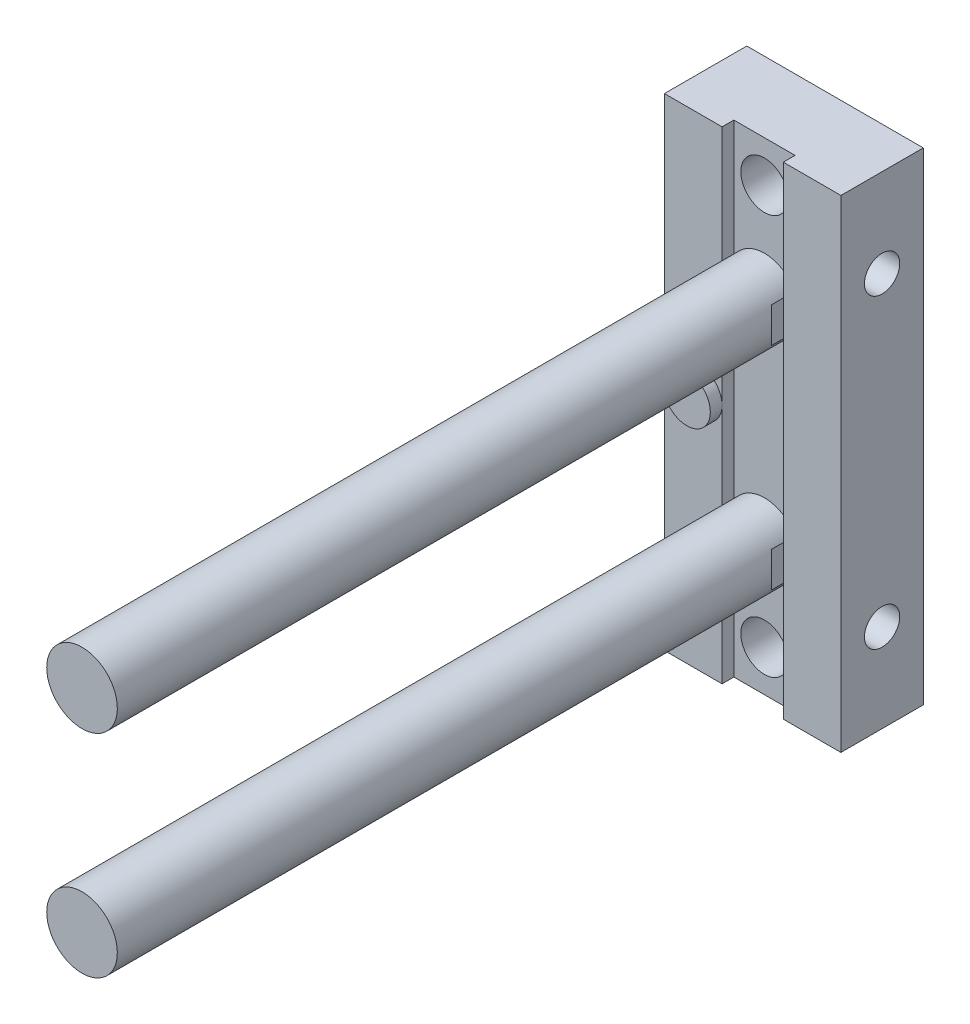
ISO-10303-21;
HEADER;
FILE_DESCRIPTION(('STEP AP214'),'2;1');
FILE_NAME('part.step','',(''),(''),'','','');
FILE_SCHEMA(('AUTOMOTIVE_DESIGN { 1 0 10303 214 1 1 1 1 }'));
ENDSEC;
DATA;
#1=APPLICATION_CONTEXT('core data for automotive mechanical design processes');
#2=APPLICATION_PROTOCOL_DEFINITION('international standard','automotive_design',2000,#1);
#3=PRODUCT_CONTEXT('',#1,'mechanical');
#4=PRODUCT('Part','Part','',(#3));
#5=PRODUCT_RELATED_PRODUCT_CATEGORY('part','',(#4));
#6=PRODUCT_DEFINITION_FORMATION('','',#4);
#7=PRODUCT_DEFINITION_CONTEXT('part definition',#1,'design');
#8=PRODUCT_DEFINITION('design','',#6,#7);
#9=PRODUCT_DEFINITION_SHAPE('','',#8);
#10=(LENGTH_UNIT() NAMED_UNIT(*) SI_UNIT(.MILLI.,.METRE.));
#11=(NAMED_UNIT(*) PLANE_ANGLE_UNIT() SI_UNIT($,.RADIAN.));
#12=(NAMED_UNIT(*) SI_UNIT($,.STERADIAN.) SOLID_ANGLE_UNIT());
#13=UNCERTAINTY_MEASURE_WITH_UNIT(LENGTH_MEASURE(1.E-05),#10,'distance_accuracy_value','');
#14=(GEOMETRIC_REPRESENTATION_CONTEXT(3) GLOBAL_UNCERTAINTY_ASSIGNED_CONTEXT((#13)) GLOBAL_UNIT_ASSIGNED_CONTEXT((#10,
#11,#12)) REPRESENTATION_CONTEXT('',''));
#15=CARTESIAN_POINT('',(0.,0.,0.));
#16=DIRECTION('',(0.,0.,1.));
#17=DIRECTION('',(1.,0.,0.));
#18=AXIS2_PLACEMENT_3D('',#15,#16,#17);
#19=CARTESIAN_POINT('',(0.,7.26794919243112,0.5));
#20=DIRECTION('',(-0.5,-0.866025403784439,0.));
#21=DIRECTION('',(0.866025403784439,-0.5,0.));
#22=AXIS2_PLACEMENT_3D('',#19,#20,#21);
#23=PLANE('',#22);
#24=DIRECTION('',(0.,0.,1.));
#25=VECTOR('',#24,1.);
#26=CARTESIAN_POINT('',(0.,7.26794919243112,0.5));
#27=LINE('',#26,#25);
#28=CARTESIAN_POINT('',(0.,7.26794919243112,2.5));
#29=VERTEX_POINT('',#28);
#30=CARTESIAN_POINT('',(0.,7.26794919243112,0.5));
#31=VERTEX_POINT('',#30);
#32=EDGE_CURVE('P0_E253',#29,#31,#27,.F.);
#33=ORIENTED_EDGE('',*,*,#32,.T.);
#34=DIRECTION('',(0.866025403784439,-0.5,0.));
#35=VECTOR('',#34,1.);
#36=CARTESIAN_POINT('',(0.,7.26794919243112,0.5));
#37=LINE('',#36,#35);
#38=CARTESIAN_POINT('',(-1.5,8.13397459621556,0.5));
#39=VERTEX_POINT('',#38);
#40=EDGE_CURVE('P0_E237',#39,#31,#37,.T.);
#41=ORIENTED_EDGE('',*,*,#40,.F.);
#42=DIRECTION('',(0.,0.,1.));
#43=VECTOR('',#42,1.);
#44=CARTESIAN_POINT('',(-1.5,8.13397459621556,0.5));
#45=LINE('',#44,#43);
#46=CARTESIAN_POINT('',(-1.5,8.13397459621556,2.5));
#47=VERTEX_POINT('',#46);
#48=EDGE_CURVE('P0_E256',#39,#47,#45,.T.);
#49=ORIENTED_EDGE('',*,*,#48,.T.);
#50=DIRECTION('',(0.866025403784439,-0.5,0.));
#51=VECTOR('',#50,1.);
#52=CARTESIAN_POINT('',(0.,7.26794919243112,2.5));
#53=LINE('',#52,#51);
#54=EDGE_CURVE('P0_E241',#29,#47,#53,.F.);
#55=ORIENTED_EDGE('',*,*,#54,.F.);
#56=EDGE_LOOP('',(#33,#41,#49,#55));
#57=FACE_BOUND('',#56,.T.);
#58=ADVANCED_FACE('P0_F34',(#57),#23,.F.);
#59=CARTESIAN_POINT('',(0.,-10.7320508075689,0.5));
#60=DIRECTION('',(-0.500000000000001,-0.866025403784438,0.));
#61=DIRECTION('',(0.866025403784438,-0.500000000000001,0.));
#62=AXIS2_PLACEMENT_3D('',#59,#60,#61);
#63=PLANE('',#62);
#64=DIRECTION('',(0.,0.,1.));
#65=VECTOR('',#64,1.);
#66=CARTESIAN_POINT('',(0.,-10.7320508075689,0.5));
#67=LINE('',#66,#65);
#68=CARTESIAN_POINT('',(0.,-10.7320508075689,2.5));
#69=VERTEX_POINT('',#68);
#70=CARTESIAN_POINT('',(0.,-10.7320508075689,0.5));
#71=VERTEX_POINT('',#70);
#72=EDGE_CURVE('P0_E266',#69,#71,#67,.F.);
#73=ORIENTED_EDGE('',*,*,#72,.T.);
#74=DIRECTION('',(0.866025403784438,-0.500000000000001,0.));
#75=VECTOR('',#74,1.);
#76=CARTESIAN_POINT('',(0.,-10.7320508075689,0.5));
#77=LINE('',#76,#75);
#78=CARTESIAN_POINT('',(-1.5,-9.86602540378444,0.5));
#79=VERTEX_POINT('',#78);
#80=EDGE_CURVE('P0_E245',#79,#71,#77,.T.);
#81=ORIENTED_EDGE('',*,*,#80,.F.);
#82=DIRECTION('',(0.,0.,1.));
#83=VECTOR('',#82,1.);
#84=CARTESIAN_POINT('',(-1.5,-9.86602540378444,0.5));
#85=LINE('',#84,#83);
#86=CARTESIAN_POINT('',(-1.5,-9.86602540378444,2.5));
#87=VERTEX_POINT('',#86);
#88=EDGE_CURVE('P0_E271',#79,#87,#85,.T.);
#89=ORIENTED_EDGE('',*,*,#88,.T.);
#90=DIRECTION('',(0.866025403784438,-0.500000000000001,0.));
#91=VECTOR('',#90,1.);
#92=CARTESIAN_POINT('',(0.,-10.7320508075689,2.5));
#93=LINE('',#92,#91);
#94=EDGE_CURVE('P0_E249',#69,#87,#93,.F.);
#95=ORIENTED_EDGE('',*,*,#94,.F.);
#96=EDGE_LOOP('',(#73,#81,#89,#95));
#97=FACE_BOUND('',#96,.T.);
#98=ADVANCED_FACE('P0_F447',(#97),#63,.F.);
#99=CARTESIAN_POINT('',(1.5,8.13397459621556,0.5));
#100=DIRECTION('',(0.5,-0.866025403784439,0.));
#101=DIRECTION('',(0.866025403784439,0.5,0.));
#102=AXIS2_PLACEMENT_3D('',#99,#100,#101);
#103=PLANE('',#102);
#104=DIRECTION('',(0.,0.,-1.));
#105=VECTOR('',#104,1.);
#106=CARTESIAN_POINT('',(1.5,8.13397459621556,0.5));
#107=LINE('',#106,#105);
#108=CARTESIAN_POINT('',(1.5,8.13397459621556,2.5));
#109=VERTEX_POINT('',#108);
#110=CARTESIAN_POINT('',(1.5,8.13397459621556,0.5));
#111=VERTEX_POINT('',#110);
#112=EDGE_CURVE('P0_E281',#109,#111,#107,.T.);
#113=ORIENTED_EDGE('',*,*,#112,.T.);
#114=DIRECTION('',(0.866025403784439,0.5,0.));
#115=VECTOR('',#114,1.);
#116=CARTESIAN_POINT('',(1.5,8.13397459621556,0.5));
#117=LINE('',#116,#115);
#118=EDGE_CURVE('P0_E239',#31,#111,#117,.T.);
#119=ORIENTED_EDGE('',*,*,#118,.F.);
#120=ORIENTED_EDGE('',*,*,#32,.F.);
#121=DIRECTION('',(0.866025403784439,0.5,0.));
#122=VECTOR('',#121,1.);
#123=CARTESIAN_POINT('',(1.5,8.13397459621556,2.5));
#124=LINE('',#123,#122);
#125=EDGE_CURVE('P0_E244',#109,#29,#124,.F.);
#126=ORIENTED_EDGE('',*,*,#125,.F.);
#127=EDGE_LOOP('',(#113,#119,#120,#126));
#128=FACE_BOUND('',#127,.T.);
#129=ADVANCED_FACE('P0_F445',(#128),#103,.F.);
#130=CARTESIAN_POINT('',(-1.5,8.13397459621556,0.5));
#131=DIRECTION('',(-1.,0.,0.));
#132=DIRECTION('',(0.,0.,1.));
#133=AXIS2_PLACEMENT_3D('',#130,#131,#132);
#134=PLANE('',#133);
#135=ORIENTED_EDGE('',*,*,#48,.F.);
#136=DIRECTION('',(0.,1.,0.));
#137=VECTOR('',#136,1.);
#138=CARTESIAN_POINT('',(-1.5,8.13397459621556,0.5));
#139=LINE('',#138,#137);
#140=CARTESIAN_POINT('',(-1.5,9.86602540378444,0.5));
#141=VERTEX_POINT('',#140);
#142=EDGE_CURVE('P0_E240',#141,#39,#139,.F.);
#143=ORIENTED_EDGE('',*,*,#142,.F.);
#144=DIRECTION('',(0.,0.,1.));
#145=VECTOR('',#144,1.);
#146=CARTESIAN_POINT('',(-1.5,9.86602540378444,0.5));
#147=LINE('',#146,#145);
#148=CARTESIAN_POINT('',(-1.5,9.86602540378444,2.5));
#149=VERTEX_POINT('',#148);
#150=EDGE_CURVE('P0_E286',#141,#149,#147,.T.);
#151=ORIENTED_EDGE('',*,*,#150,.T.);
#152=DIRECTION('',(0.,1.,0.));
#153=VECTOR('',#152,1.);
#154=CARTESIAN_POINT('',(-1.5,8.13397459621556,2.5));
#155=LINE('',#154,#153);
#156=EDGE_CURVE('P0_E243',#47,#149,#155,.T.);
#157=ORIENTED_EDGE('',*,*,#156,.F.);
#158=EDGE_LOOP('',(#135,#143,#151,#157));
#159=FACE_BOUND('',#158,.T.);
#160=ADVANCED_FACE('P0_F440',(#159),#134,.F.);
#161=CARTESIAN_POINT('',(1.5,-9.86602540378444,0.5));
#162=DIRECTION('',(0.499999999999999,-0.866025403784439,0.));
#163=DIRECTION('',(0.866025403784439,0.499999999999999,0.));
#164=AXIS2_PLACEMENT_3D('',#161,#162,#163);
#165=PLANE('',#164);
#166=DIRECTION('',(0.,0.,-1.));
#167=VECTOR('',#166,1.);
#168=CARTESIAN_POINT('',(1.5,-9.86602540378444,0.5));
#169=LINE('',#168,#167);
#170=CARTESIAN_POINT('',(1.5,-9.86602540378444,2.5));
#171=VERTEX_POINT('',#170);
#172=CARTESIAN_POINT('',(1.5,-9.86602540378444,0.5));
#173=VERTEX_POINT('',#172);
#174=EDGE_CURVE('P0_E292',#171,#173,#169,.T.);
#175=ORIENTED_EDGE('',*,*,#174,.T.);
#176=DIRECTION('',(0.866025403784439,0.499999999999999,0.));
#177=VECTOR('',#176,1.);
#178=CARTESIAN_POINT('',(1.5,-9.86602540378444,0.5));
#179=LINE('',#178,#177);
#180=EDGE_CURVE('P0_E247',#71,#173,#179,.T.);
#181=ORIENTED_EDGE('',*,*,#180,.F.);
#182=ORIENTED_EDGE('',*,*,#72,.F.);
#183=DIRECTION('',(0.866025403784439,0.499999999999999,0.));
#184=VECTOR('',#183,1.);
#185=CARTESIAN_POINT('',(1.5,-9.86602540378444,2.5));
#186=LINE('',#185,#184);
#187=EDGE_CURVE('P0_E252',#171,#69,#186,.F.);
#188=ORIENTED_EDGE('',*,*,#187,.F.);
#189=EDGE_LOOP('',(#175,#181,#182,#188));
#190=FACE_BOUND('',#189,.T.);
#191=ADVANCED_FACE('P0_F453',(#190),#165,.F.);
#192=CARTESIAN_POINT('',(-1.5,-9.86602540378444,0.5));
#193=DIRECTION('',(-1.,0.,0.));
#194=DIRECTION('',(0.,0.,1.));
#195=AXIS2_PLACEMENT_3D('',#192,#193,#194);
#196=PLANE('',#195);
#197=ORIENTED_EDGE('',*,*,#88,.F.);
#198=DIRECTION('',(0.,1.,0.));
#199=VECTOR('',#198,1.);
#200=CARTESIAN_POINT('',(-1.5,-9.86602540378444,0.5));
#201=LINE('',#200,#199);
#202=CARTESIAN_POINT('',(-1.5,-8.13397459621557,0.5));
#203=VERTEX_POINT('',#202);
#204=EDGE_CURVE('P0_E248',#203,#79,#201,.F.);
#205=ORIENTED_EDGE('',*,*,#204,.F.);
#206=DIRECTION('',(0.,0.,1.));
#207=VECTOR('',#206,1.);
#208=CARTESIAN_POINT('',(-1.5,-8.13397459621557,0.5));
#209=LINE('',#208,#207);
#210=CARTESIAN_POINT('',(-1.5,-8.13397459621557,2.5));
#211=VERTEX_POINT('',#210);
#212=EDGE_CURVE('P0_E301',#203,#211,#209,.T.);
#213=ORIENTED_EDGE('',*,*,#212,.T.);
#214=DIRECTION('',(0.,1.,0.));
#215=VECTOR('',#214,1.);
#216=CARTESIAN_POINT('',(-1.5,-9.86602540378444,2.5));
#217=LINE('',#216,#215);
#218=EDGE_CURVE('P0_E251',#87,#211,#217,.T.);
#219=ORIENTED_EDGE('',*,*,#218,.F.);
#220=EDGE_LOOP('',(#197,#205,#213,#219));
#221=FACE_BOUND('',#220,.T.);
#222=ADVANCED_FACE('P0_F1271',(#221),#196,.F.);
#223=CARTESIAN_POINT('',(1.5,9.86602540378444,0.5));
#224=DIRECTION('',(1.,0.,0.));
#225=DIRECTION('',(0.,0.,-1.));
#226=AXIS2_PLACEMENT_3D('',#223,#224,#225);
#227=PLANE('',#226);
#228=DIRECTION('',(0.,0.,1.));
#229=VECTOR('',#228,1.);
#230=CARTESIAN_POINT('',(1.5,9.86602540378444,0.5));
#231=LINE('',#230,#229);
#232=CARTESIAN_POINT('',(1.5,9.86602540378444,2.5));
#233=VERTEX_POINT('',#232);
#234=CARTESIAN_POINT('',(1.5,9.86602540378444,0.5));
#235=VERTEX_POINT('',#234);
#236=EDGE_CURVE('P0_E298',#233,#235,#231,.F.);
#237=ORIENTED_EDGE('',*,*,#236,.T.);
#238=DIRECTION('',(0.,1.,0.));
#239=VECTOR('',#238,1.);
#240=CARTESIAN_POINT('',(1.5,9.86602540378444,0.5));
#241=LINE('',#240,#239);
#242=EDGE_CURVE('P0_E258',#111,#235,#241,.T.);
#243=ORIENTED_EDGE('',*,*,#242,.F.);
#244=ORIENTED_EDGE('',*,*,#112,.F.);
#245=DIRECTION('',(0.,1.,0.));
#246=VECTOR('',#245,1.);
#247=CARTESIAN_POINT('',(1.5,9.,2.5));
#248=LINE('',#247,#246);
#249=EDGE_CURVE('P0_E296',#109,#233,#248,.T.);
#250=ORIENTED_EDGE('',*,*,#249,.T.);
#251=EDGE_LOOP('',(#237,#243,#244,#250));
#252=FACE_BOUND('',#251,.T.);
#253=ADVANCED_FACE('P0_F429',(#252),#227,.F.);
#254=CARTESIAN_POINT('',(-1.5,9.86602540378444,0.5));
#255=DIRECTION('',(-0.5,0.866025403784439,0.));
#256=DIRECTION('',(-0.866025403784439,-0.5,0.));
#257=AXIS2_PLACEMENT_3D('',#254,#255,#256);
#258=PLANE('',#257);
#259=ORIENTED_EDGE('',*,*,#150,.F.);
#260=DIRECTION('',(-0.866025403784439,-0.5,0.));
#261=VECTOR('',#260,1.);
#262=CARTESIAN_POINT('',(-1.5,9.86602540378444,0.5));
#263=LINE('',#262,#261);
#264=CARTESIAN_POINT('',(0.,10.7320508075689,0.5));
#265=VERTEX_POINT('',#264);
#266=EDGE_CURVE('P0_E263',#265,#141,#263,.T.);
#267=ORIENTED_EDGE('',*,*,#266,.F.);
#268=DIRECTION('',(0.,0.,1.));
#269=VECTOR('',#268,1.);
#270=CARTESIAN_POINT('',(0.,10.7320508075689,0.5));
#271=LINE('',#270,#269);
#272=CARTESIAN_POINT('',(0.,10.7320508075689,2.5));
#273=VERTEX_POINT('',#272);
#274=EDGE_CURVE('P0_E295',#265,#273,#271,.T.);
#275=ORIENTED_EDGE('',*,*,#274,.T.);
#276=DIRECTION('',(-0.866025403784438,-0.5,0.));
#277=VECTOR('',#276,1.);
#278=CARTESIAN_POINT('',(0.,10.7320508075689,2.5));
#279=LINE('',#278,#277);
#280=EDGE_CURVE('P0_E261',#273,#149,#279,.T.);
#281=ORIENTED_EDGE('',*,*,#280,.T.);
#282=EDGE_LOOP('',(#259,#267,#275,#281));
#283=FACE_BOUND('',#282,.T.);
#284=ADVANCED_FACE('P0_F437',(#283),#258,.F.);
#285=CARTESIAN_POINT('',(0.,9.,2.5));
#286=DIRECTION('',(0.,0.,1.));
#287=DIRECTION('',(1.,0.,0.));
#288=AXIS2_PLACEMENT_3D('',#285,#286,#287);
#289=PLANE('',#288);
#290=ORIENTED_EDGE('',*,*,#249,.F.);
#291=ORIENTED_EDGE('',*,*,#125,.T.);
#292=ORIENTED_EDGE('',*,*,#54,.T.);
#293=ORIENTED_EDGE('',*,*,#156,.T.);
#294=ORIENTED_EDGE('',*,*,#280,.F.);
#295=DIRECTION('',(-0.866025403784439,0.5,0.));
#296=VECTOR('',#295,1.);
#297=CARTESIAN_POINT('',(0.,10.7320508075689,2.5));
#298=LINE('',#297,#296);
#299=EDGE_CURVE('P0_E268',#273,#233,#298,.F.);
#300=ORIENTED_EDGE('',*,*,#299,.T.);
#301=EDGE_LOOP('',(#290,#291,#292,#293,#294,#300));
#302=FACE_BOUND('',#301,.T.);
#303=ADVANCED_FACE('P0_F433',(#302),#289,.F.);
#304=CARTESIAN_POINT('',(1.5,-8.13397459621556,0.5));
#305=DIRECTION('',(1.,0.,0.));
#306=DIRECTION('',(0.,0.,-1.));
#307=AXIS2_PLACEMENT_3D('',#304,#305,#306);
#308=PLANE('',#307);
#309=DIRECTION('',(0.,0.,1.));
#310=VECTOR('',#309,1.);
#311=CARTESIAN_POINT('',(1.5,-8.13397459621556,0.5));
#312=LINE('',#311,#310);
#313=CARTESIAN_POINT('',(1.5,-8.13397459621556,2.5));
#314=VERTEX_POINT('',#313);
#315=CARTESIAN_POINT('',(1.5,-8.13397459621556,0.5));
#316=VERTEX_POINT('',#315);
#317=EDGE_CURVE('P0_E312',#314,#316,#312,.F.);
#318=ORIENTED_EDGE('',*,*,#317,.T.);
#319=DIRECTION('',(0.,1.,0.));
#320=VECTOR('',#319,1.);
#321=CARTESIAN_POINT('',(1.5,-8.13397459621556,0.5));
#322=LINE('',#321,#320);
#323=EDGE_CURVE('P0_E273',#173,#316,#322,.T.);
#324=ORIENTED_EDGE('',*,*,#323,.F.);
#325=ORIENTED_EDGE('',*,*,#174,.F.);
#326=DIRECTION('',(0.,1.,0.));
#327=VECTOR('',#326,1.);
#328=CARTESIAN_POINT('',(1.5,-9.,2.5));
#329=LINE('',#328,#327);
#330=EDGE_CURVE('P0_E310',#171,#314,#329,.T.);
#331=ORIENTED_EDGE('',*,*,#330,.T.);
#332=EDGE_LOOP('',(#318,#324,#325,#331));
#333=FACE_BOUND('',#332,.T.);
#334=ADVANCED_FACE('P0_F1306',(#333),#308,.F.);
#335=CARTESIAN_POINT('',(-1.5,-8.13397459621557,0.5));
#336=DIRECTION('',(-0.500000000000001,0.866025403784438,0.));
#337=DIRECTION('',(-0.866025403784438,-0.500000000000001,0.));
#338=AXIS2_PLACEMENT_3D('',#335,#336,#337);
#339=PLANE('',#338);
#340=ORIENTED_EDGE('',*,*,#212,.F.);
#341=DIRECTION('',(-0.866025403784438,-0.500000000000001,0.));
#342=VECTOR('',#341,1.);
#343=CARTESIAN_POINT('',(-1.5,-8.13397459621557,0.5));
#344=LINE('',#343,#342);
#345=CARTESIAN_POINT('',(0.,-7.26794919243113,0.5));
#346=VERTEX_POINT('',#345);
#347=EDGE_CURVE('P0_E278',#346,#203,#344,.T.);
#348=ORIENTED_EDGE('',*,*,#347,.F.);
#349=DIRECTION('',(0.,0.,1.));
#350=VECTOR('',#349,1.);
#351=CARTESIAN_POINT('',(0.,-7.26794919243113,0.5));
#352=LINE('',#351,#350);
#353=CARTESIAN_POINT('',(0.,-7.26794919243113,2.5));
#354=VERTEX_POINT('',#353);
#355=EDGE_CURVE('P0_E309',#346,#354,#352,.T.);
#356=ORIENTED_EDGE('',*,*,#355,.T.);
#357=DIRECTION('',(-0.866025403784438,-0.500000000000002,0.));
#358=VECTOR('',#357,1.);
#359=CARTESIAN_POINT('',(0.,-7.26794919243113,2.5));
#360=LINE('',#359,#358);
#361=EDGE_CURVE('P0_E276',#354,#211,#360,.T.);
#362=ORIENTED_EDGE('',*,*,#361,.T.);
#363=EDGE_LOOP('',(#340,#348,#356,#362));
#364=FACE_BOUND('',#363,.T.);
#365=ADVANCED_FACE('P0_F1315',(#364),#339,.F.);
#366=CARTESIAN_POINT('',(0.,-9.,2.5));
#367=DIRECTION('',(0.,0.,1.));
#368=DIRECTION('',(1.,0.,0.));
#369=AXIS2_PLACEMENT_3D('',#366,#367,#368);
#370=PLANE('',#369);
#371=ORIENTED_EDGE('',*,*,#330,.F.);
#372=ORIENTED_EDGE('',*,*,#187,.T.);
#373=ORIENTED_EDGE('',*,*,#94,.T.);
#374=ORIENTED_EDGE('',*,*,#218,.T.);
#375=ORIENTED_EDGE('',*,*,#361,.F.);
#376=DIRECTION('',(-0.86602540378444,0.499999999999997,0.));
#377=VECTOR('',#376,1.);
#378=CARTESIAN_POINT('',(0.,-7.26794919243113,2.5));
#379=LINE('',#378,#377);
#380=EDGE_CURVE('P0_E283',#354,#314,#379,.F.);
#381=ORIENTED_EDGE('',*,*,#380,.T.);
#382=EDGE_LOOP('',(#371,#372,#373,#374,#375,#381));
#383=FACE_BOUND('',#382,.T.);
#384=ADVANCED_FACE('P0_F1325',(#383),#370,.F.);
#385=CARTESIAN_POINT('',(0.,10.7320508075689,0.5));
#386=DIRECTION('',(0.5,0.866025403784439,0.));
#387=DIRECTION('',(-0.866025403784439,0.5,0.));
#388=AXIS2_PLACEMENT_3D('',#385,#386,#387);
#389=PLANE('',#388);
#390=ORIENTED_EDGE('',*,*,#274,.F.);
#391=DIRECTION('',(0.866025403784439,-0.5,0.));
#392=VECTOR('',#391,1.);
#393=CARTESIAN_POINT('',(0.,10.7320508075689,0.5));
#394=LINE('',#393,#392);
#395=EDGE_CURVE('P0_E323',#265,#235,#394,.T.);
#396=ORIENTED_EDGE('',*,*,#395,.T.);
#397=ORIENTED_EDGE('',*,*,#236,.F.);
#398=ORIENTED_EDGE('',*,*,#299,.F.);
#399=EDGE_LOOP('',(#390,#396,#397,#398));
#400=FACE_BOUND('',#399,.T.);
#401=ADVANCED_FACE('P0_F421',(#400),#389,.F.);
#402=CARTESIAN_POINT('',(0.,-7.26794919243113,0.5));
#403=DIRECTION('',(0.499999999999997,0.86602540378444,0.));
#404=DIRECTION('',(-0.86602540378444,0.499999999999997,0.));
#405=AXIS2_PLACEMENT_3D('',#402,#403,#404);
#406=PLANE('',#405);
#407=ORIENTED_EDGE('',*,*,#355,.F.);
#408=DIRECTION('',(0.86602540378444,-0.499999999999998,0.));
#409=VECTOR('',#408,1.);
#410=CARTESIAN_POINT('',(0.,-7.26794919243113,0.5));
#411=LINE('',#410,#409);
#412=EDGE_CURVE('P0_E289',#346,#316,#411,.T.);
#413=ORIENTED_EDGE('',*,*,#412,.T.);
#414=ORIENTED_EDGE('',*,*,#317,.F.);
#415=ORIENTED_EDGE('',*,*,#380,.F.);
#416=EDGE_LOOP('',(#407,#413,#414,#415));
#417=FACE_BOUND('',#416,.T.);
#418=ADVANCED_FACE('P0_F406',(#417),#406,.F.);
#419=CARTESIAN_POINT('',(0.,9.,0.5));
#420=DIRECTION('',(0.,0.,1.));
#421=DIRECTION('',(1.,0.,0.));
#422=AXIS2_PLACEMENT_3D('',#419,#420,#421);
#423=PLANE('',#422);
#424=ORIENTED_EDGE('',*,*,#266,.T.);
#425=ORIENTED_EDGE('',*,*,#142,.T.);
#426=ORIENTED_EDGE('',*,*,#40,.T.);
#427=ORIENTED_EDGE('',*,*,#118,.T.);
#428=ORIENTED_EDGE('',*,*,#242,.T.);
#429=ORIENTED_EDGE('',*,*,#395,.F.);
#430=EDGE_LOOP('',(#424,#425,#426,#427,#428,#429));
#431=FACE_BOUND('',#430,.T.);
#432=CARTESIAN_POINT('',(0.,9.,0.5));
#433=DIRECTION('',(0.,0.,1.));
#434=DIRECTION('',(-1.,0.,0.));
#435=AXIS2_PLACEMENT_3D('',#432,#433,#434);
#436=CIRCLE('',#435,2.5);
#437=CARTESIAN_POINT('',(-2.5,9.,0.5));
#438=VERTEX_POINT('',#437);
#439=EDGE_CURVE('P0_E929',#438,#438,#436,.T.);
#440=ORIENTED_EDGE('',*,*,#439,.F.);
#441=EDGE_LOOP('',(#440));
#442=FACE_BOUND('',#441,.T.);
#443=ADVANCED_FACE('P0_F401',(#431,#442),#423,.F.);
#444=CARTESIAN_POINT('',(0.,-9.,0.5));
#445=DIRECTION('',(0.,0.,1.));
#446=DIRECTION('',(1.,0.,0.));
#447=AXIS2_PLACEMENT_3D('',#444,#445,#446);
#448=PLANE('',#447);
#449=ORIENTED_EDGE('',*,*,#347,.T.);
#450=ORIENTED_EDGE('',*,*,#204,.T.);
#451=ORIENTED_EDGE('',*,*,#80,.T.);
#452=ORIENTED_EDGE('',*,*,#180,.T.);
#453=ORIENTED_EDGE('',*,*,#323,.T.);
#454=ORIENTED_EDGE('',*,*,#412,.F.);
#455=EDGE_LOOP('',(#449,#450,#451,#452,#453,#454));
#456=FACE_BOUND('',#455,.T.);
#457=CARTESIAN_POINT('',(0.,-9.,0.5));
#458=DIRECTION('',(0.,0.,1.));
#459=DIRECTION('',(-1.,0.,0.));
#460=AXIS2_PLACEMENT_3D('',#457,#458,#459);
#461=CIRCLE('',#460,2.5);
#462=CARTESIAN_POINT('',(-2.5,-9.,0.5));
#463=VERTEX_POINT('',#462);
#464=EDGE_CURVE('P0_E386',#463,#463,#461,.T.);
#465=ORIENTED_EDGE('',*,*,#464,.F.);
#466=EDGE_LOOP('',(#465));
#467=FACE_BOUND('',#466,.T.);
#468=ADVANCED_FACE('P0_F392',(#456,#467),#448,.F.);
#469=CARTESIAN_POINT('',(0.,9.,3.5));
#470=DIRECTION('',(0.,0.,1.));
#471=DIRECTION('',(1.,0.,0.));
#472=AXIS2_PLACEMENT_3D('',#469,#470,#471);
#473=PLANE('',#472);
#474=CARTESIAN_POINT('',(0.,9.,3.5));
#475=DIRECTION('',(0.,0.,1.));
#476=DIRECTION('',(1.,0.,0.));
#477=AXIS2_PLACEMENT_3D('',#474,#475,#476);
#478=CIRCLE('',#477,3.5);
#479=CARTESIAN_POINT('',(2.44948974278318,11.5,3.5));
#480=VERTEX_POINT('',#479);
#481=CARTESIAN_POINT('',(-2.44948974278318,11.5,3.5));
#482=VERTEX_POINT('',#481);
#483=EDGE_CURVE('P0_E303',#480,#482,#478,.F.);
#484=ORIENTED_EDGE('',*,*,#483,.T.);
#485=DIRECTION('',(1.,0.,0.));
#486=VECTOR('',#485,1.);
#487=CARTESIAN_POINT('',(0.,11.5,3.5));
#488=LINE('',#487,#486);
#489=CARTESIAN_POINT('',(-1.6583123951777,11.5,3.5));
#490=VERTEX_POINT('',#489);
#491=EDGE_CURVE('P0_E921',#490,#482,#488,.F.);
#492=ORIENTED_EDGE('',*,*,#491,.F.);
#493=CARTESIAN_POINT('',(0.,9.,3.5));
#494=DIRECTION('',(0.,0.,-1.));
#495=DIRECTION('',(-1.,0.,0.));
#496=AXIS2_PLACEMENT_3D('',#493,#494,#495);
#497=CIRCLE('',#496,3.);
#498=CARTESIAN_POINT('',(1.6583123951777,11.5,3.5));
#499=VERTEX_POINT('',#498);
#500=EDGE_CURVE('P0_E595',#499,#490,#497,.T.);
#501=ORIENTED_EDGE('',*,*,#500,.F.);
#502=DIRECTION('',(1.,0.,0.));
#503=VECTOR('',#502,1.);
#504=CARTESIAN_POINT('',(0.,11.5,3.5));
#505=LINE('',#504,#503);
#506=EDGE_CURVE('P0_E349',#480,#499,#505,.F.);
#507=ORIENTED_EDGE('',*,*,#506,.F.);
#508=EDGE_LOOP('',(#484,#492,#501,#507));
#509=FACE_BOUND('',#508,.T.);
#510=ADVANCED_FACE('P0_F342',(#509),#473,.F.);
#511=CARTESIAN_POINT('',(0.,9.,1.));
#512=DIRECTION('',(0.,0.,1.));
#513=DIRECTION('',(1.,0.,0.));
#514=AXIS2_PLACEMENT_3D('',#511,#512,#513);
#515=TOROIDAL_SURFACE('',#514,2.5,0.5);
#516=CARTESIAN_POINT('',(0.,9.,1.));
#517=DIRECTION('',(0.,0.,-1.));
#518=DIRECTION('',(-1.,0.,0.));
#519=AXIS2_PLACEMENT_3D('',#516,#517,#518);
#520=CIRCLE('',#519,3.);
#521=CARTESIAN_POINT('',(-3.,9.,1.));
#522=VERTEX_POINT('',#521);
#523=EDGE_CURVE('P0_E634',#522,#522,#520,.F.);
#524=ORIENTED_EDGE('',*,*,#523,.F.);
#525=EDGE_LOOP('',(#524));
#526=FACE_BOUND('',#525,.T.);
#527=ORIENTED_EDGE('',*,*,#439,.T.);
#528=EDGE_LOOP('',(#527));
#529=FACE_BOUND('',#528,.T.);
#530=ADVANCED_FACE('P0_F330',(#526,#529),#515,.T.);
#531=CARTESIAN_POINT('',(0.,-9.,3.5));
#532=DIRECTION('',(0.,0.,1.));
#533=DIRECTION('',(1.,0.,0.));
#534=AXIS2_PLACEMENT_3D('',#531,#532,#533);
#535=PLANE('',#534);
#536=CARTESIAN_POINT('',(0.,-9.,3.5));
#537=DIRECTION('',(0.,0.,1.));
#538=DIRECTION('',(1.,0.,0.));
#539=AXIS2_PLACEMENT_3D('',#536,#537,#538);
#540=CIRCLE('',#539,3.5);
#541=CARTESIAN_POINT('',(-2.44948974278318,-11.5,3.5));
#542=VERTEX_POINT('',#541);
#543=CARTESIAN_POINT('',(2.44948974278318,-11.5,3.5));
#544=VERTEX_POINT('',#543);
#545=EDGE_CURVE('P0_E942',#542,#544,#540,.F.);
#546=ORIENTED_EDGE('',*,*,#545,.T.);
#547=DIRECTION('',(1.,0.,0.));
#548=VECTOR('',#547,1.);
#549=CARTESIAN_POINT('',(0.,-11.5,3.5));
#550=LINE('',#549,#548);
#551=CARTESIAN_POINT('',(1.6583123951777,-11.5,3.5));
#552=VERTEX_POINT('',#551);
#553=EDGE_CURVE('P0_E351',#552,#544,#550,.T.);
#554=ORIENTED_EDGE('',*,*,#553,.F.);
#555=CARTESIAN_POINT('',(0.,-9.,3.5));
#556=DIRECTION('',(0.,0.,-1.));
#557=DIRECTION('',(-1.,0.,0.));
#558=AXIS2_PLACEMENT_3D('',#555,#556,#557);
#559=CIRCLE('',#558,3.);
#560=CARTESIAN_POINT('',(-1.6583123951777,-11.5,3.5));
#561=VERTEX_POINT('',#560);
#562=EDGE_CURVE('P0_E945',#561,#552,#559,.T.);
#563=ORIENTED_EDGE('',*,*,#562,.F.);
#564=DIRECTION('',(1.,0.,0.));
#565=VECTOR('',#564,1.);
#566=CARTESIAN_POINT('',(0.,-11.5,3.5));
#567=LINE('',#566,#565);
#568=EDGE_CURVE('P0_E354',#542,#561,#567,.T.);
#569=ORIENTED_EDGE('',*,*,#568,.F.);
#570=EDGE_LOOP('',(#546,#554,#563,#569));
#571=FACE_BOUND('',#570,.T.);
#572=ADVANCED_FACE('P0_F341',(#571),#535,.F.);
#573=CARTESIAN_POINT('',(0.,-9.,1.));
#574=DIRECTION('',(0.,0.,1.));
#575=DIRECTION('',(1.,0.,0.));
#576=AXIS2_PLACEMENT_3D('',#573,#574,#575);
#577=TOROIDAL_SURFACE('',#576,2.5,0.5);
#578=CARTESIAN_POINT('',(0.,-9.,1.));
#579=DIRECTION('',(0.,0.,-1.));
#580=DIRECTION('',(-1.,0.,0.));
#581=AXIS2_PLACEMENT_3D('',#578,#579,#580);
#582=CIRCLE('',#581,3.);
#583=CARTESIAN_POINT('',(-3.,-9.,1.));
#584=VERTEX_POINT('',#583);
#585=EDGE_CURVE('P0_E957',#584,#584,#582,.F.);
#586=ORIENTED_EDGE('',*,*,#585,.F.);
#587=EDGE_LOOP('',(#586));
#588=FACE_BOUND('',#587,.T.);
#589=ORIENTED_EDGE('',*,*,#464,.T.);
#590=EDGE_LOOP('',(#589));
#591=FACE_BOUND('',#590,.T.);
#592=ADVANCED_FACE('P0_F362',(#588,#591),#577,.T.);
#593=CARTESIAN_POINT('',(0.,9.,0.));
#594=DIRECTION('',(0.,0.,1.));
#595=DIRECTION('',(1.,0.,0.));
#596=AXIS2_PLACEMENT_3D('',#593,#594,#595);
#597=CYLINDRICAL_SURFACE('',#596,3.5);
#598=ORIENTED_EDGE('',*,*,#483,.F.);
#599=CARTESIAN_POINT('',(2.44948974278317,11.5,3.5));
#600=CARTESIAN_POINT('',(2.44948905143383,11.4999967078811,3.46849015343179));
#601=CARTESIAN_POINT('',(2.44847576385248,11.5009938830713,3.43699740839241));
#602=CARTESIAN_POINT('',(2.4444316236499,11.5049483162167,3.37427557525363));
#603=CARTESIAN_POINT('',(2.44140142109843,11.5079049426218,3.34304640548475));
#604=CARTESIAN_POINT('',(2.42934163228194,11.519609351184,3.25041899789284));
#605=CARTESIAN_POINT('',(2.41734256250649,11.5311926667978,3.1897188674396));
#606=CARTESIAN_POINT('',(2.38571028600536,11.5610252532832,3.072173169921));
#607=CARTESIAN_POINT('',(2.36608206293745,11.5792701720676,3.01532511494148));
#608=CARTESIAN_POINT('',(2.31967333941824,11.6210852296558,2.90671842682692));
#609=CARTESIAN_POINT('',(2.2928879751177,11.6446589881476,2.85496328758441));
#610=CARTESIAN_POINT('',(2.23194297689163,11.6963058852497,2.75595961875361));
#611=CARTESIAN_POINT('',(2.19758555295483,11.7244931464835,2.70889375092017));
#612=CARTESIAN_POINT('',(2.12288586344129,11.7830949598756,2.6214107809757));
#613=CARTESIAN_POINT('',(2.0825410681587,11.8135104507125,2.58099650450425));
#614=CARTESIAN_POINT('',(1.97462215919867,11.8908856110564,2.48746910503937));
#615=CARTESIAN_POINT('',(1.90373147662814,11.9382923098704,2.43854722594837));
#616=CARTESIAN_POINT('',(1.75309184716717,12.0305973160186,2.35360523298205));
#617=CARTESIAN_POINT('',(1.67332168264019,12.0754892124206,2.31761693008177));
#618=CARTESIAN_POINT('',(1.530318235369,12.1484431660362,2.26457429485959));
#619=CARTESIAN_POINT('',(1.46859321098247,12.1777317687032,2.24503549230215));
#620=CARTESIAN_POINT('',(1.34244509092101,12.2330453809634,2.21048602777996));
#621=CARTESIAN_POINT('',(1.27802082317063,12.2590689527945,2.19547735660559));
#622=CARTESIAN_POINT('',(1.1470020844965,12.3074570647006,2.16915694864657));
#623=CARTESIAN_POINT('',(1.08040510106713,12.3298171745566,2.15784967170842));
#624=CARTESIAN_POINT('',(0.945573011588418,12.3705867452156,2.13825498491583));
#625=CARTESIAN_POINT('',(0.877337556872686,12.3889953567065,2.12996822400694));
#626=CARTESIAN_POINT('',(0.720552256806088,12.4262178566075,2.11389200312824));
#627=CARTESIAN_POINT('',(0.631612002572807,12.4437309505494,2.10687643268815));
#628=CARTESIAN_POINT('',(0.452443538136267,12.471818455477,2.095988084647));
#629=CARTESIAN_POINT('',(0.362215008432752,12.4823911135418,2.09211610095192));
#630=CARTESIAN_POINT('',(0.181057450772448,12.4964952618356,2.08701045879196));
#631=CARTESIAN_POINT('',(0.0901278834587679,12.5000206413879,2.08577908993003));
#632=CARTESIAN_POINT('',(-0.0917190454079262,12.4999791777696,2.0857938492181));
#633=CARTESIAN_POINT('',(-0.182636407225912,12.4964130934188,2.08703971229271));
#634=CARTESIAN_POINT('',(-0.36434702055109,12.4821834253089,2.09219178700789));
#635=CARTESIAN_POINT('',(-0.455136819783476,12.471480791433,2.09611263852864));
#636=CARTESIAN_POINT('',(-0.635439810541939,12.4430432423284,2.10714963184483));
#637=CARTESIAN_POINT('',(-0.724952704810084,12.4253067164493,2.11426650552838));
#638=CARTESIAN_POINT('',(-0.901769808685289,12.383053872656,2.13255433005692));
#639=CARTESIAN_POINT('',(-0.989078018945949,12.3585509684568,2.14371727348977));
#640=CARTESIAN_POINT('',(-1.16073272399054,12.3031540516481,2.17133085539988));
#641=CARTESIAN_POINT('',(-1.24508125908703,12.2722645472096,2.1877777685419));
#642=CARTESIAN_POINT('',(-1.42350723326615,12.1991223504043,2.23086839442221));
#643=CARTESIAN_POINT('',(-1.51687512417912,12.1558345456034,2.25875162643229));
#644=CARTESIAN_POINT('',(-1.69582251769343,12.0633755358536,2.32696021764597));
#645=CARTESIAN_POINT('',(-1.78141532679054,12.0142147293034,2.36726378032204));
#646=CARTESIAN_POINT('',(-1.92351543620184,11.9249718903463,2.45252843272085));
#647=CARTESIAN_POINT('',(-1.98220471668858,11.8853755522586,2.4943323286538));
#648=CARTESIAN_POINT('',(-2.09138733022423,11.8072378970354,2.58838643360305));
#649=CARTESIAN_POINT('',(-2.14189140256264,11.7686952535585,2.64062275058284));
#650=CARTESIAN_POINT('',(-2.2246035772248,11.7024860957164,2.74530490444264));
#651=CARTESIAN_POINT('',(-2.25846867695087,11.6741155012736,2.7959903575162));
#652=CARTESIAN_POINT('',(-2.31856324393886,11.6221830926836,2.90401014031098));
#653=CARTESIAN_POINT('',(-2.34479190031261,11.5986217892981,2.96134517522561));
#654=CARTESIAN_POINT('',(-2.38896451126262,11.5580777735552,3.08176256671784));
#655=CARTESIAN_POINT('',(-2.40685594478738,11.5411368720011,3.14487843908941));
#656=CARTESIAN_POINT('',(-2.43356434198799,11.5155746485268,3.27455888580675));
#657=CARTESIAN_POINT('',(-2.4424019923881,11.5069343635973,3.34111523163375));
#658=CARTESIAN_POINT('',(-2.44757187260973,11.501877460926,3.42340222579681));
#659=CARTESIAN_POINT('',(-2.44829146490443,11.5011733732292,3.43871639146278));
#660=CARTESIAN_POINT('',(-2.44924964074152,11.5002355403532,3.46935155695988));
#661=CARTESIAN_POINT('',(-2.44948893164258,11.5000011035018,3.48467251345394));
#662=CARTESIAN_POINT('',(-2.44948974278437,11.5,3.49999999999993));
#663=B_SPLINE_CURVE_WITH_KNOTS('',3,(#599,#600,#601,#602,#603,#604,#605,#606,#607,#608,#609,
#610,#611,#612,#613,#614,#615,#616,#617,#618,#619,#620,#621,#622,#623,#624,#625,#626,#627,#628,
#629,#630,#631,#632,#633,#634,#635,#636,#637,#638,#639,#640,#641,#642,#643,#644,#645,#646,#647,
#648,#649,#650,#651,#652,#653,#654,#655,#656,#657,#658,#659,#660,#661,#662),.UNSPECIFIED.,.F.,
.F.,(4,2,2,2,2,2,2,2,2,2,2,2,2,2,2,2,2,2,2,2,2,2,2,2,2,2,2,2,2,2,2,4),(0.,0.0944641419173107,
0.188897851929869,0.376694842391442,0.564369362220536,0.752171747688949,0.945629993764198,
1.13917021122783,1.43246570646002,1.72647772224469,1.93938664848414,2.15238900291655,
2.36564706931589,2.57895092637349,2.85135262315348,3.12382309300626,3.39652971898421,
3.66920716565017,3.94338904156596,4.217633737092,4.49133862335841,4.76485096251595,
5.0837699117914,5.40213234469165,5.64790624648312,5.89335502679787,6.09423470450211,
6.29513570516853,6.49728573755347,6.69897284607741,6.74500643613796,6.79097218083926),.UNSPECIFIED.);
#664=EDGE_CURVE('P0_E635',#480,#482,#663,.T.);
#665=ORIENTED_EDGE('',*,*,#664,.T.);
#666=EDGE_LOOP('',(#598,#665));
#667=FACE_BOUND('',#666,.T.);
#668=CARTESIAN_POINT('',(0.,9.,0.500000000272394));
#669=DIRECTION('',(0.,0.,-1.));
#670=DIRECTION('',(1.,0.,0.));
#671=AXIS2_PLACEMENT_3D('',#668,#669,#670);
#672=CIRCLE('',#671,3.50000000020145);
#673=CARTESIAN_POINT('',(3.50000000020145,9.,0.500000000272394));
#674=VERTEX_POINT('',#673);
#675=EDGE_CURVE('P0_E632',#674,#674,#672,.T.);
#676=ORIENTED_EDGE('',*,*,#675,.T.);
#677=EDGE_LOOP('',(#676));
#678=FACE_BOUND('',#677,.T.);
#679=ADVANCED_FACE('P0_F366',(#667,#678),#597,.F.);
#680=CARTESIAN_POINT('',(0.,9.,3.5));
#681=DIRECTION('',(0.,0.,-1.));
#682=DIRECTION('',(-1.,0.,0.));
#683=AXIS2_PLACEMENT_3D('',#680,#681,#682);
#684=CYLINDRICAL_SURFACE('',#683,3.);
#685=ORIENTED_EDGE('',*,*,#523,.T.);
#686=EDGE_LOOP('',(#685));
#687=FACE_BOUND('',#686,.T.);
#688=CARTESIAN_POINT('',(-1.65831239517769,11.5,3.5));
#689=CARTESIAN_POINT('',(-1.65831320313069,11.499996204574,3.47338955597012));
#690=CARTESIAN_POINT('',(-1.65724403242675,11.500708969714,3.44679560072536));
#691=CARTESIAN_POINT('',(-1.6529882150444,11.5035254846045,3.39386577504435));
#692=CARTESIAN_POINT('',(-1.64980268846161,11.5056284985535,3.36752977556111));
#693=CARTESIAN_POINT('',(-1.63717148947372,11.5139163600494,3.2896227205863));
#694=CARTESIAN_POINT('',(-1.62465023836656,11.5220814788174,3.23871903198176));
#695=CARTESIAN_POINT('',(-1.59195973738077,11.542839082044,3.14054860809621));
#696=CARTESIAN_POINT('',(-1.5718016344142,11.5554251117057,3.09327669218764));
#697=CARTESIAN_POINT('',(-1.52464608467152,11.583836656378,3.00329828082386));
#698=CARTESIAN_POINT('',(-1.49763872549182,11.5996668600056,2.96059853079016));
#699=CARTESIAN_POINT('',(-1.43077052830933,11.6371717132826,2.87105086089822));
#700=CARTESIAN_POINT('',(-1.38938095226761,11.6593482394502,2.82555939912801));
#701=CARTESIAN_POINT('',(-1.29954908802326,11.7043869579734,2.7426208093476));
#702=CARTESIAN_POINT('',(-1.25109689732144,11.7272500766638,2.70518516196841));
#703=CARTESIAN_POINT('',(-1.13079465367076,11.7797421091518,2.62594650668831));
#704=CARTESIAN_POINT('',(-1.05671355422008,11.8089183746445,2.58724785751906));
#705=CARTESIAN_POINT('',(-0.901941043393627,11.8623841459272,2.52141185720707));
#706=CARTESIAN_POINT('',(-0.82123816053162,11.8866649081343,2.49429509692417));
#707=CARTESIAN_POINT('',(-0.683637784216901,11.9216189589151,2.45716914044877));
#708=CARTESIAN_POINT('',(-0.627891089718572,11.9341197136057,2.44447462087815));
#709=CARTESIAN_POINT('',(-0.515057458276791,11.9560134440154,2.42281304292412));
#710=CARTESIAN_POINT('',(-0.457970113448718,11.9654054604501,2.41384713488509));
#711=CARTESIAN_POINT('',(-0.342903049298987,11.9809045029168,2.39929273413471));
#712=CARTESIAN_POINT('',(-0.284922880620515,11.9870098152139,2.39370600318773));
#713=CARTESIAN_POINT('',(-0.16846261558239,11.9958357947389,2.38568863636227));
#714=CARTESIAN_POINT('',(-0.109982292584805,11.9985548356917,2.38325951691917));
#715=CARTESIAN_POINT('',(0.00785870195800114,12.0005760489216,2.38145016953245));
#716=CARTESIAN_POINT('',(0.0672207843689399,11.9998325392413,2.38211070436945));
#717=CARTESIAN_POINT('',(0.185650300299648,11.9948364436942,2.38660098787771));
#718=CARTESIAN_POINT('',(0.244717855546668,11.9905854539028,2.39042929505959));
#719=CARTESIAN_POINT('',(0.36217388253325,11.9786425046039,2.40141198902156));
#720=CARTESIAN_POINT('',(0.420562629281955,11.9709519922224,2.40856497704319));
#721=CARTESIAN_POINT('',(0.536224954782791,11.9522698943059,2.42648867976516));
#722=CARTESIAN_POINT('',(0.593498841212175,11.9412792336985,2.43725838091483));
#723=CARTESIAN_POINT('',(0.736466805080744,11.909542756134,2.46962519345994));
#724=CARTESIAN_POINT('',(0.821121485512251,11.8867147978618,2.49393536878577));
#725=CARTESIAN_POINT('',(0.984332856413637,11.8352022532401,2.55405590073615));
#726=CARTESIAN_POINT('',(1.06289960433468,11.8065276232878,2.58984676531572));
#727=CARTESIAN_POINT('',(1.19136720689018,11.7539314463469,2.66406146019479));
#728=CARTESIAN_POINT('',(1.24337966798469,11.7307376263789,2.69932885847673));
#729=CARTESIAN_POINT('',(1.34066859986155,11.6843057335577,2.7781734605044));
#730=CARTESIAN_POINT('',(1.38595503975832,11.6610677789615,2.82173814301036));
#731=CARTESIAN_POINT('',(1.46014706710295,11.6209559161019,2.90833881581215));
#732=CARTESIAN_POINT('',(1.49053142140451,11.6037077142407,2.9499289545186));
#733=CARTESIAN_POINT('',(1.54453431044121,11.5720411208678,3.03833720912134));
#734=CARTESIAN_POINT('',(1.56815168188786,11.5576232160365,3.08515622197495));
#735=CARTESIAN_POINT('',(1.60776325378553,11.5329135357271,3.18339060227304));
#736=CARTESIAN_POINT('',(1.62369916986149,11.5226533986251,3.23483770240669));
#737=CARTESIAN_POINT('',(1.64689142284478,11.507578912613,3.34033292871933));
#738=CARTESIAN_POINT('',(1.65417211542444,11.502749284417,3.39437330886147));
#739=CARTESIAN_POINT('',(1.65787345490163,11.5002895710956,3.46576324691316));
#740=CARTESIAN_POINT('',(1.65831700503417,11.4999939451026,3.48288660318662));
#741=CARTESIAN_POINT('',(1.65831239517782,11.5,3.49999999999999));
#742=B_SPLINE_CURVE_WITH_KNOTS('',3,(#688,#689,#690,#691,#692,#693,#694,#695,#696,#697,#698,
#699,#700,#701,#702,#703,#704,#705,#706,#707,#708,#709,#710,#711,#712,#713,#714,#715,#716,#717,
#718,#719,#720,#721,#722,#723,#724,#725,#726,#727,#728,#729,#730,#731,#732,#733,#734,#735,#736,
#737,#738,#739,#740,#741),.UNSPECIFIED.,.F.,.F.,(4,2,2,2,2,2,2,2,2,2,2,2,2,2,2,2,2,2,2,2,2,2,2,
2,2,2,4),(0.,0.0797685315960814,0.159494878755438,0.317667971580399,0.47561107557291,
0.633784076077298,0.828860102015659,1.02421232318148,1.28835733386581,1.55297001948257,
1.72834019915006,1.90376444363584,2.0792800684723,2.25487995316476,2.43280306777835,
2.61064526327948,2.78841270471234,2.96613036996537,3.23811464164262,3.50963955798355,
3.70990104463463,3.90986268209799,4.07216227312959,4.23448974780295,4.39803024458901,
4.56110944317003,4.6124692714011),.UNSPECIFIED.);
#743=EDGE_CURVE('P0_E596',#490,#499,#742,.T.);
#744=ORIENTED_EDGE('',*,*,#743,.T.);
#745=ORIENTED_EDGE('',*,*,#500,.T.);
#746=EDGE_LOOP('',(#744,#745));
#747=FACE_BOUND('',#746,.T.);
#748=ADVANCED_FACE('P0_F605',(#687,#747),#684,.T.);
#749=CARTESIAN_POINT('',(0.,-9.,0.));
#750=DIRECTION('',(0.,0.,1.));
#751=DIRECTION('',(1.,0.,0.));
#752=AXIS2_PLACEMENT_3D('',#749,#750,#751);
#753=CYLINDRICAL_SURFACE('',#752,3.5);
#754=ORIENTED_EDGE('',*,*,#545,.F.);
#755=CARTESIAN_POINT('',(-2.44948974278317,-11.5,3.5));
#756=CARTESIAN_POINT('',(-2.44948905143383,-11.4999967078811,3.46849015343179));
#757=CARTESIAN_POINT('',(-2.44847576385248,-11.5009938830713,3.43699740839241));
#758=CARTESIAN_POINT('',(-2.4444316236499,-11.5049483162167,3.37427557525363));
#759=CARTESIAN_POINT('',(-2.44140142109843,-11.5079049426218,3.34304640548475));
#760=CARTESIAN_POINT('',(-2.42934163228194,-11.519609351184,3.25041899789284));
#761=CARTESIAN_POINT('',(-2.41734256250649,-11.5311926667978,3.1897188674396));
#762=CARTESIAN_POINT('',(-2.38571028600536,-11.5610252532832,3.072173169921));
#763=CARTESIAN_POINT('',(-2.36608206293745,-11.5792701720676,3.01532511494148));
#764=CARTESIAN_POINT('',(-2.31967333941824,-11.6210852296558,2.90671842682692));
#765=CARTESIAN_POINT('',(-2.2928879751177,-11.6446589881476,2.85496328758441));
#766=CARTESIAN_POINT('',(-2.23194297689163,-11.6963058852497,2.75595961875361));
#767=CARTESIAN_POINT('',(-2.19758555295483,-11.7244931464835,2.70889375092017));
#768=CARTESIAN_POINT('',(-2.12288586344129,-11.7830949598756,2.6214107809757));
#769=CARTESIAN_POINT('',(-2.0825410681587,-11.8135104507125,2.58099650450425));
#770=CARTESIAN_POINT('',(-1.97462215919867,-11.8908856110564,2.48746910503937));
#771=CARTESIAN_POINT('',(-1.90373147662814,-11.9382923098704,2.43854722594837));
#772=CARTESIAN_POINT('',(-1.75309184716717,-12.0305973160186,2.35360523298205));
#773=CARTESIAN_POINT('',(-1.67332168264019,-12.0754892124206,2.31761693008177));
#774=CARTESIAN_POINT('',(-1.530318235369,-12.1484431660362,2.26457429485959));
#775=CARTESIAN_POINT('',(-1.46859321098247,-12.1777317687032,2.24503549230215));
#776=CARTESIAN_POINT('',(-1.34244509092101,-12.2330453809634,2.21048602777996));
#777=CARTESIAN_POINT('',(-1.27802082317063,-12.2590689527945,2.19547735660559));
#778=CARTESIAN_POINT('',(-1.1470020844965,-12.3074570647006,2.16915694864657));
#779=CARTESIAN_POINT('',(-1.08040510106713,-12.3298171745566,2.15784967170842));
#780=CARTESIAN_POINT('',(-0.945573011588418,-12.3705867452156,2.13825498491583));
#781=CARTESIAN_POINT('',(-0.877337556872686,-12.3889953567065,2.12996822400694));
#782=CARTESIAN_POINT('',(-0.720552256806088,-12.4262178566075,2.11389200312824));
#783=CARTESIAN_POINT('',(-0.631612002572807,-12.4437309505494,2.10687643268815));
#784=CARTESIAN_POINT('',(-0.452443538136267,-12.471818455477,2.095988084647));
#785=CARTESIAN_POINT('',(-0.362215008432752,-12.4823911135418,2.09211610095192));
#786=CARTESIAN_POINT('',(-0.181057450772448,-12.4964952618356,2.08701045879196));
#787=CARTESIAN_POINT('',(-0.0901278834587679,-12.5000206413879,2.08577908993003));
#788=CARTESIAN_POINT('',(0.0917190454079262,-12.4999791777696,2.0857938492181));
#789=CARTESIAN_POINT('',(0.182636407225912,-12.4964130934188,2.08703971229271));
#790=CARTESIAN_POINT('',(0.36434702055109,-12.4821834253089,2.09219178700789));
#791=CARTESIAN_POINT('',(0.455136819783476,-12.471480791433,2.09611263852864));
#792=CARTESIAN_POINT('',(0.635439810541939,-12.4430432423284,2.10714963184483));
#793=CARTESIAN_POINT('',(0.724952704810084,-12.4253067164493,2.11426650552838));
#794=CARTESIAN_POINT('',(0.901769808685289,-12.383053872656,2.13255433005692));
#795=CARTESIAN_POINT('',(0.989078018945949,-12.3585509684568,2.14371727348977));
#796=CARTESIAN_POINT('',(1.16073272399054,-12.3031540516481,2.17133085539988));
#797=CARTESIAN_POINT('',(1.24508125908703,-12.2722645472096,2.1877777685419));
#798=CARTESIAN_POINT('',(1.42350723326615,-12.1991223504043,2.23086839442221));
#799=CARTESIAN_POINT('',(1.51687512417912,-12.1558345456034,2.25875162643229));
#800=CARTESIAN_POINT('',(1.69582251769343,-12.0633755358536,2.32696021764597));
#801=CARTESIAN_POINT('',(1.78141532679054,-12.0142147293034,2.36726378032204));
#802=CARTESIAN_POINT('',(1.92351543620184,-11.9249718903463,2.45252843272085));
#803=CARTESIAN_POINT('',(1.98220471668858,-11.8853755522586,2.4943323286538));
#804=CARTESIAN_POINT('',(2.09138733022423,-11.8072378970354,2.58838643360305));
#805=CARTESIAN_POINT('',(2.14189140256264,-11.7686952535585,2.64062275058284));
#806=CARTESIAN_POINT('',(2.2246035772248,-11.7024860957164,2.74530490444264));
#807=CARTESIAN_POINT('',(2.25846867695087,-11.6741155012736,2.7959903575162));
#808=CARTESIAN_POINT('',(2.31856324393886,-11.6221830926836,2.90401014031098));
#809=CARTESIAN_POINT('',(2.34479190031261,-11.5986217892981,2.96134517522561));
#810=CARTESIAN_POINT('',(2.38896451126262,-11.5580777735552,3.08176256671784));
#811=CARTESIAN_POINT('',(2.40685594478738,-11.5411368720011,3.14487843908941));
#812=CARTESIAN_POINT('',(2.43356434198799,-11.5155746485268,3.27455888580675));
#813=CARTESIAN_POINT('',(2.4424019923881,-11.5069343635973,3.34111523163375));
#814=CARTESIAN_POINT('',(2.44757187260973,-11.501877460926,3.42340222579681));
#815=CARTESIAN_POINT('',(2.44829146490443,-11.5011733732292,3.43871639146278));
#816=CARTESIAN_POINT('',(2.44924964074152,-11.5002355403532,3.46935155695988));
#817=CARTESIAN_POINT('',(2.44948893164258,-11.5000011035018,3.48467251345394));
#818=CARTESIAN_POINT('',(2.44948974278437,-11.5,3.49999999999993));
#819=B_SPLINE_CURVE_WITH_KNOTS('',3,(#755,#756,#757,#758,#759,#760,#761,#762,#763,#764,#765,
#766,#767,#768,#769,#770,#771,#772,#773,#774,#775,#776,#777,#778,#779,#780,#781,#782,#783,#784,
#785,#786,#787,#788,#789,#790,#791,#792,#793,#794,#795,#796,#797,#798,#799,#800,#801,#802,#803,
#804,#805,#806,#807,#808,#809,#810,#811,#812,#813,#814,#815,#816,#817,#818),.UNSPECIFIED.,.F.,
.F.,(4,2,2,2,2,2,2,2,2,2,2,2,2,2,2,2,2,2,2,2,2,2,2,2,2,2,2,2,2,2,2,4),(0.,0.0944641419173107,
0.188897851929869,0.376694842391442,0.564369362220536,0.752171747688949,0.945629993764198,
1.13917021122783,1.43246570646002,1.72647772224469,1.93938664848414,2.15238900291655,
2.36564706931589,2.57895092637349,2.85135262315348,3.12382309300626,3.39652971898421,
3.66920716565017,3.94338904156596,4.217633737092,4.49133862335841,4.76485096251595,
5.0837699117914,5.40213234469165,5.64790624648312,5.89335502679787,6.09423470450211,
6.29513570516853,6.49728573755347,6.69897284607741,6.74500643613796,6.79097218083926),.UNSPECIFIED.);
#820=EDGE_CURVE('P0_E587',#542,#544,#819,.T.);
#821=ORIENTED_EDGE('',*,*,#820,.T.);
#822=EDGE_LOOP('',(#754,#821));
#823=FACE_BOUND('',#822,.T.);
#824=CARTESIAN_POINT('',(0.,-9.,0.500000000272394));
#825=DIRECTION('',(0.,0.,-1.));
#826=DIRECTION('',(1.,0.,0.));
#827=AXIS2_PLACEMENT_3D('',#824,#825,#826);
#828=CIRCLE('',#827,3.50000000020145);
#829=CARTESIAN_POINT('',(3.50000000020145,-9.,0.500000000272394));
#830=VERTEX_POINT('',#829);
#831=EDGE_CURVE('P0_E594',#830,#830,#828,.T.);
#832=ORIENTED_EDGE('',*,*,#831,.T.);
#833=EDGE_LOOP('',(#832));
#834=FACE_BOUND('',#833,.T.);
#835=ADVANCED_FACE('P0_F601',(#823,#834),#753,.F.);
#836=CARTESIAN_POINT('',(0.,-9.,3.5));
#837=DIRECTION('',(0.,0.,-1.));
#838=DIRECTION('',(-1.,0.,0.));
#839=AXIS2_PLACEMENT_3D('',#836,#837,#838);
#840=CYLINDRICAL_SURFACE('',#839,3.);
#841=ORIENTED_EDGE('',*,*,#585,.T.);
#842=EDGE_LOOP('',(#841));
#843=FACE_BOUND('',#842,.T.);
#844=CARTESIAN_POINT('',(1.65831239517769,-11.5,3.5));
#845=CARTESIAN_POINT('',(1.65831320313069,-11.499996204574,3.47338955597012));
#846=CARTESIAN_POINT('',(1.65724403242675,-11.500708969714,3.44679560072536));
#847=CARTESIAN_POINT('',(1.6529882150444,-11.5035254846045,3.39386577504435));
#848=CARTESIAN_POINT('',(1.64980268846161,-11.5056284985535,3.36752977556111));
#849=CARTESIAN_POINT('',(1.63717148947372,-11.5139163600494,3.2896227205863));
#850=CARTESIAN_POINT('',(1.62465023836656,-11.5220814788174,3.23871903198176));
#851=CARTESIAN_POINT('',(1.59195973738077,-11.542839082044,3.14054860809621));
#852=CARTESIAN_POINT('',(1.5718016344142,-11.5554251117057,3.09327669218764));
#853=CARTESIAN_POINT('',(1.52464608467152,-11.583836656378,3.00329828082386));
#854=CARTESIAN_POINT('',(1.49763872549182,-11.5996668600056,2.96059853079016));
#855=CARTESIAN_POINT('',(1.43077052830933,-11.6371717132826,2.87105086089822));
#856=CARTESIAN_POINT('',(1.38938095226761,-11.6593482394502,2.82555939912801));
#857=CARTESIAN_POINT('',(1.29954908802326,-11.7043869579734,2.7426208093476));
#858=CARTESIAN_POINT('',(1.25109689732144,-11.7272500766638,2.70518516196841));
#859=CARTESIAN_POINT('',(1.13079465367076,-11.7797421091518,2.62594650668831));
#860=CARTESIAN_POINT('',(1.05671355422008,-11.8089183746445,2.58724785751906));
#861=CARTESIAN_POINT('',(0.901941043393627,-11.8623841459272,2.52141185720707));
#862=CARTESIAN_POINT('',(0.82123816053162,-11.8866649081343,2.49429509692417));
#863=CARTESIAN_POINT('',(0.683637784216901,-11.9216189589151,2.45716914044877));
#864=CARTESIAN_POINT('',(0.627891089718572,-11.9341197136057,2.44447462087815));
#865=CARTESIAN_POINT('',(0.515057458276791,-11.9560134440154,2.42281304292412));
#866=CARTESIAN_POINT('',(0.457970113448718,-11.9654054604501,2.41384713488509));
#867=CARTESIAN_POINT('',(0.342903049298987,-11.9809045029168,2.39929273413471));
#868=CARTESIAN_POINT('',(0.284922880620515,-11.9870098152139,2.39370600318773));
#869=CARTESIAN_POINT('',(0.16846261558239,-11.9958357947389,2.38568863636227));
#870=CARTESIAN_POINT('',(0.109982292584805,-11.9985548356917,2.38325951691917));
#871=CARTESIAN_POINT('',(-0.00785870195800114,-12.0005760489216,2.38145016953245));
#872=CARTESIAN_POINT('',(-0.0672207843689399,-11.9998325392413,2.38211070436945));
#873=CARTESIAN_POINT('',(-0.185650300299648,-11.9948364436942,2.38660098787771));
#874=CARTESIAN_POINT('',(-0.244717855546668,-11.9905854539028,2.39042929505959));
#875=CARTESIAN_POINT('',(-0.36217388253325,-11.9786425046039,2.40141198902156));
#876=CARTESIAN_POINT('',(-0.420562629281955,-11.9709519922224,2.40856497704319));
#877=CARTESIAN_POINT('',(-0.536224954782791,-11.9522698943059,2.42648867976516));
#878=CARTESIAN_POINT('',(-0.593498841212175,-11.9412792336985,2.43725838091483));
#879=CARTESIAN_POINT('',(-0.736466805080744,-11.909542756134,2.46962519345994));
#880=CARTESIAN_POINT('',(-0.821121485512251,-11.8867147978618,2.49393536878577));
#881=CARTESIAN_POINT('',(-0.984332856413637,-11.8352022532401,2.55405590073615));
#882=CARTESIAN_POINT('',(-1.06289960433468,-11.8065276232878,2.58984676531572));
#883=CARTESIAN_POINT('',(-1.19136720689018,-11.7539314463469,2.66406146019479));
#884=CARTESIAN_POINT('',(-1.24337966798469,-11.7307376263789,2.69932885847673));
#885=CARTESIAN_POINT('',(-1.34066859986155,-11.6843057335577,2.7781734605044));
#886=CARTESIAN_POINT('',(-1.38595503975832,-11.6610677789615,2.82173814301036));
#887=CARTESIAN_POINT('',(-1.46014706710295,-11.6209559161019,2.90833881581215));
#888=CARTESIAN_POINT('',(-1.49053142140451,-11.6037077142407,2.9499289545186));
#889=CARTESIAN_POINT('',(-1.54453431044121,-11.5720411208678,3.03833720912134));
#890=CARTESIAN_POINT('',(-1.56815168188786,-11.5576232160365,3.08515622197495));
#891=CARTESIAN_POINT('',(-1.60776325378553,-11.5329135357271,3.18339060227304));
#892=CARTESIAN_POINT('',(-1.62369916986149,-11.5226533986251,3.23483770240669));
#893=CARTESIAN_POINT('',(-1.64689142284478,-11.507578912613,3.34033292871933));
#894=CARTESIAN_POINT('',(-1.65417211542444,-11.502749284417,3.39437330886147));
#895=CARTESIAN_POINT('',(-1.65787345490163,-11.5002895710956,3.46576324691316));
#896=CARTESIAN_POINT('',(-1.65831700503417,-11.4999939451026,3.48288660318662));
#897=CARTESIAN_POINT('',(-1.65831239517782,-11.5,3.49999999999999));
#898=B_SPLINE_CURVE_WITH_KNOTS('',3,(#844,#845,#846,#847,#848,#849,#850,#851,#852,#853,#854,
#855,#856,#857,#858,#859,#860,#861,#862,#863,#864,#865,#866,#867,#868,#869,#870,#871,#872,#873,
#874,#875,#876,#877,#878,#879,#880,#881,#882,#883,#884,#885,#886,#887,#888,#889,#890,#891,#892,
#893,#894,#895,#896,#897),.UNSPECIFIED.,.F.,.F.,(4,2,2,2,2,2,2,2,2,2,2,2,2,2,2,2,2,2,2,2,2,2,2,
2,2,2,4),(0.,0.0797685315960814,0.159494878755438,0.317667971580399,0.47561107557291,
0.633784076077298,0.828860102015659,1.02421232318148,1.28835733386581,1.55297001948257,
1.72834019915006,1.90376444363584,2.0792800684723,2.25487995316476,2.43280306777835,
2.61064526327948,2.78841270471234,2.96613036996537,3.23811464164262,3.50963955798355,
3.70990104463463,3.90986268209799,4.07216227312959,4.23448974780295,4.39803024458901,
4.56110944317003,4.6124692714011),.UNSPECIFIED.);
#899=EDGE_CURVE('P0_E580',#552,#561,#898,.T.);
#900=ORIENTED_EDGE('',*,*,#899,.T.);
#901=ORIENTED_EDGE('',*,*,#562,.T.);
#902=EDGE_LOOP('',(#900,#901));
#903=FACE_BOUND('',#902,.T.);
#904=ADVANCED_FACE('P0_F604',(#843,#903),#840,.T.);
#905=CARTESIAN_POINT('',(-4.6,0.,8.));
#906=DIRECTION('',(0.,0.,-1.));
#907=DIRECTION('',(-1.,0.,0.));
#908=AXIS2_PLACEMENT_3D('',#905,#906,#907);
#909=PLANE('',#908);
#910=CARTESIAN_POINT('',(-4.6,0.,8.));
#911=DIRECTION('',(0.,0.,1.));
#912=DIRECTION('',(1.,0.,0.));
#913=AXIS2_PLACEMENT_3D('',#910,#911,#912);
#914=CIRCLE('',#913,2.);
#915=CARTESIAN_POINT('',(-2.6,0.,8.));
#916=VERTEX_POINT('',#915);
#917=EDGE_CURVE('P0_E357',#916,#916,#914,.F.);
#918=ORIENTED_EDGE('',*,*,#917,.F.);
#919=EDGE_LOOP('',(#918));
#920=FACE_BOUND('',#919,.T.);
#921=ADVANCED_FACE('P0_F611',(#920),#909,.F.);
#922=CARTESIAN_POINT('',(0.,-9.,-2.27373675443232E-10));
#923=DIRECTION('',(0.,0.,-1.));
#924=DIRECTION('',(-1.,0.,0.));
#925=AXIS2_PLACEMENT_3D('',#922,#923,#924);
#926=CONICAL_SURFACE('',#925,3.99999999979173,0.785398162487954);
#927=CARTESIAN_POINT('',(0.,-9.,-2.27373675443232E-10));
#928=DIRECTION('',(0.,0.,-1.));
#929=DIRECTION('',(-1.,0.,0.));
#930=AXIS2_PLACEMENT_3D('',#927,#928,#929);
#931=CIRCLE('',#930,3.99999999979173);
#932=CARTESIAN_POINT('',(-3.99999999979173,-9.,-2.27373675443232E-10));
#933=VERTEX_POINT('',#932);
#934=EDGE_CURVE('P0_E947',#933,#933,#931,.T.);
#935=ORIENTED_EDGE('',*,*,#934,.T.);
#936=EDGE_LOOP('',(#935));
#937=FACE_BOUND('',#936,.T.);
#938=ORIENTED_EDGE('',*,*,#831,.F.);
#939=EDGE_LOOP('',(#938));
#940=FACE_BOUND('',#939,.T.);
#941=ADVANCED_FACE('P0_F615',(#937,#940),#926,.F.);
#942=CARTESIAN_POINT('',(0.,9.,-2.27373675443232E-10));
#943=DIRECTION('',(0.,0.,-1.));
#944=DIRECTION('',(-1.,0.,0.));
#945=AXIS2_PLACEMENT_3D('',#942,#943,#944);
#946=CONICAL_SURFACE('',#945,3.99999999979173,0.785398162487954);
#947=CARTESIAN_POINT('',(0.,9.,-2.27373675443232E-10));
#948=DIRECTION('',(0.,0.,-1.));
#949=DIRECTION('',(-1.,0.,0.));
#950=AXIS2_PLACEMENT_3D('',#947,#948,#949);
#951=CIRCLE('',#950,3.99999999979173);
#952=CARTESIAN_POINT('',(-3.99999999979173,9.,-2.27373675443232E-10));
#953=VERTEX_POINT('',#952);
#954=EDGE_CURVE('P0_E629',#953,#953,#951,.T.);
#955=ORIENTED_EDGE('',*,*,#954,.T.);
#956=EDGE_LOOP('',(#955));
#957=FACE_BOUND('',#956,.T.);
#958=ORIENTED_EDGE('',*,*,#675,.F.);
#959=EDGE_LOOP('',(#958));
#960=FACE_BOUND('',#959,.T.);
#961=ADVANCED_FACE('P0_F618',(#957,#960),#946,.F.);
#962=CARTESIAN_POINT('',(-7.5,13.,3.5));
#963=DIRECTION('',(1.,0.,0.));
#964=DIRECTION('',(0.,0.,-1.));
#965=AXIS2_PLACEMENT_3D('',#962,#963,#964);
#966=CYLINDRICAL_SURFACE('',#965,1.5);
#967=CARTESIAN_POINT('',(-7.5,13.,3.5));
#968=DIRECTION('',(1.,0.,0.));
#969=DIRECTION('',(0.,0.,-1.));
#970=AXIS2_PLACEMENT_3D('',#967,#968,#969);
#971=CIRCLE('',#970,1.5);
#972=CARTESIAN_POINT('',(-7.5,13.,2.));
#973=VERTEX_POINT('',#972);
#974=EDGE_CURVE('P0_E690',#973,#973,#971,.T.);
#975=ORIENTED_EDGE('',*,*,#974,.F.);
#976=EDGE_LOOP('',(#975));
#977=FACE_BOUND('',#976,.T.);
#978=CARTESIAN_POINT('',(7.5,13.,3.5));
#979=DIRECTION('',(1.,0.,0.));
#980=DIRECTION('',(0.,0.,-1.));
#981=AXIS2_PLACEMENT_3D('',#978,#979,#980);
#982=CIRCLE('',#981,1.5);
#983=CARTESIAN_POINT('',(7.5,13.,2.));
#984=VERTEX_POINT('',#983);
#985=EDGE_CURVE('P0_E700',#984,#984,#982,.F.);
#986=ORIENTED_EDGE('',*,*,#985,.F.);
#987=EDGE_LOOP('',(#986));
#988=FACE_BOUND('',#987,.T.);
#989=ORIENTED_EDGE('',*,*,#491,.T.);
#990=ORIENTED_EDGE('',*,*,#664,.F.);
#991=ORIENTED_EDGE('',*,*,#506,.T.);
#992=ORIENTED_EDGE('',*,*,#743,.F.);
#993=EDGE_LOOP('',(#989,#990,#991,#992));
#994=FACE_BOUND('',#993,.T.);
#995=ADVANCED_FACE('P0_F574',(#977,#988,#994),#966,.F.);
#996=CARTESIAN_POINT('',(-7.5,-13.,3.5));
#997=DIRECTION('',(1.,0.,0.));
#998=DIRECTION('',(0.,0.,-1.));
#999=AXIS2_PLACEMENT_3D('',#996,#997,#998);
#1000=CYLINDRICAL_SURFACE('',#999,1.5);
#1001=CARTESIAN_POINT('',(-7.5,-13.,3.5));
#1002=DIRECTION('',(1.,0.,0.));
#1003=DIRECTION('',(0.,0.,-1.));
#1004=AXIS2_PLACEMENT_3D('',#1001,#1002,#1003);
#1005=CIRCLE('',#1004,1.5);
#1006=CARTESIAN_POINT('',(-7.5,-13.,2.));
#1007=VERTEX_POINT('',#1006);
#1008=EDGE_CURVE('P0_E773',#1007,#1007,#1005,.T.);
#1009=ORIENTED_EDGE('',*,*,#1008,.F.);
#1010=EDGE_LOOP('',(#1009));
#1011=FACE_BOUND('',#1010,.T.);
#1012=CARTESIAN_POINT('',(7.5,-13.,3.5));
#1013=DIRECTION('',(1.,0.,0.));
#1014=DIRECTION('',(0.,0.,-1.));
#1015=AXIS2_PLACEMENT_3D('',#1012,#1013,#1014);
#1016=CIRCLE('',#1015,1.5);
#1017=CARTESIAN_POINT('',(7.5,-13.,2.));
#1018=VERTEX_POINT('',#1017);
#1019=EDGE_CURVE('P0_E1451',#1018,#1018,#1016,.F.);
#1020=ORIENTED_EDGE('',*,*,#1019,.F.);
#1021=EDGE_LOOP('',(#1020));
#1022=FACE_BOUND('',#1021,.T.);
#1023=ORIENTED_EDGE('',*,*,#553,.T.);
#1024=ORIENTED_EDGE('',*,*,#820,.F.);
#1025=ORIENTED_EDGE('',*,*,#568,.T.);
#1026=ORIENTED_EDGE('',*,*,#899,.F.);
#1027=EDGE_LOOP('',(#1023,#1024,#1025,#1026));
#1028=FACE_BOUND('',#1027,.T.);
#1029=ADVANCED_FACE('P0_F569',(#1011,#1022,#1028),#1000,.F.);
#1030=CARTESIAN_POINT('',(-4.6,0.,7.));
#1031=DIRECTION('',(0.,0.,1.));
#1032=DIRECTION('',(1.,0.,0.));
#1033=AXIS2_PLACEMENT_3D('',#1030,#1031,#1032);
#1034=CYLINDRICAL_SURFACE('',#1033,2.);
#1035=CARTESIAN_POINT('',(-4.6,0.,7.));
#1036=DIRECTION('',(0.,0.,1.));
#1037=DIRECTION('',(1.,0.,0.));
#1038=AXIS2_PLACEMENT_3D('',#1035,#1036,#1037);
#1039=CIRCLE('',#1038,2.);
#1040=CARTESIAN_POINT('',(-2.6,0.,7.));
#1041=VERTEX_POINT('',#1040);
#1042=EDGE_CURVE('P0_E710',#1041,#1041,#1039,.F.);
#1043=ORIENTED_EDGE('',*,*,#1042,.F.);
#1044=EDGE_LOOP('',(#1043));
#1045=FACE_BOUND('',#1044,.T.);
#1046=ORIENTED_EDGE('',*,*,#917,.T.);
#1047=EDGE_LOOP('',(#1046));
#1048=FACE_BOUND('',#1047,.T.);
#1049=ADVANCED_FACE('P0_F565',(#1045,#1048),#1034,.T.);
#1050=CARTESIAN_POINT('',(0.,17.,-2.27373675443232E-10));
#1051=DIRECTION('',(0.,0.,-1.));
#1052=DIRECTION('',(-1.,0.,0.));
#1053=AXIS2_PLACEMENT_3D('',#1050,#1051,#1052);
#1054=CONICAL_SURFACE('',#1053,2.50546525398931,0.785398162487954);
#1055=CARTESIAN_POINT('',(0.,17.,-2.27373675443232E-10));
#1056=DIRECTION('',(0.,0.,-1.));
#1057=DIRECTION('',(-1.,0.,0.));
#1058=AXIS2_PLACEMENT_3D('',#1055,#1056,#1057);
#1059=CIRCLE('',#1058,2.50546525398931);
#1060=CARTESIAN_POINT('',(-2.50546525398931,17.,-2.27373675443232E-10));
#1061=VERTEX_POINT('',#1060);
#1062=EDGE_CURVE('P0_E774',#1061,#1061,#1059,.T.);
#1063=ORIENTED_EDGE('',*,*,#1062,.T.);
#1064=EDGE_LOOP('',(#1063));
#1065=FACE_BOUND('',#1064,.T.);
#1066=CARTESIAN_POINT('',(0.,17.,0.5));
#1067=DIRECTION('',(0.,0.,1.));
#1068=DIRECTION('',(1.,0.,0.));
#1069=AXIS2_PLACEMENT_3D('',#1066,#1067,#1068);
#1070=CIRCLE('',#1069,2.00546525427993);
#1071=CARTESIAN_POINT('',(2.00546525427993,17.,0.5));
#1072=VERTEX_POINT('',#1071);
#1073=EDGE_CURVE('P0_E770',#1072,#1072,#1070,.T.);
#1074=ORIENTED_EDGE('',*,*,#1073,.T.);
#1075=EDGE_LOOP('',(#1074));
#1076=FACE_BOUND('',#1075,.T.);
#1077=ADVANCED_FACE('P0_F561',(#1065,#1076),#1054,.F.);
#1078=CARTESIAN_POINT('',(-7.5,-20.5,0.));
#1079=DIRECTION('',(-1.,0.,0.));
#1080=DIRECTION('',(0.,0.,1.));
#1081=AXIS2_PLACEMENT_3D('',#1078,#1079,#1080);
#1082=PLANE('',#1081);
#1083=ORIENTED_EDGE('',*,*,#1008,.T.);
#1084=EDGE_LOOP('',(#1083));
#1085=FACE_BOUND('',#1084,.T.);
#1086=ORIENTED_EDGE('',*,*,#974,.T.);
#1087=EDGE_LOOP('',(#1086));
#1088=FACE_BOUND('',#1087,.T.);
#1089=DIRECTION('',(0.,1.,0.));
#1090=VECTOR('',#1089,1.);
#1091=CARTESIAN_POINT('',(-7.5,0.,0.));
#1092=LINE('',#1091,#1090);
#1093=CARTESIAN_POINT('',(-7.5,20.5,0.));
#1094=VERTEX_POINT('',#1093);
#1095=CARTESIAN_POINT('',(-7.5,-20.5,0.));
#1096=VERTEX_POINT('',#1095);
#1097=EDGE_CURVE('P0_E687',#1094,#1096,#1092,.F.);
#1098=ORIENTED_EDGE('',*,*,#1097,.T.);
#1099=DIRECTION('',(0.,0.,-1.));
#1100=VECTOR('',#1099,1.);
#1101=CARTESIAN_POINT('',(-7.5,-20.5,0.));
#1102=LINE('',#1101,#1100);
#1103=CARTESIAN_POINT('',(-7.5,-20.5,7.));
#1104=VERTEX_POINT('',#1103);
#1105=EDGE_CURVE('P0_E680',#1104,#1096,#1102,.T.);
#1106=ORIENTED_EDGE('',*,*,#1105,.F.);
#1107=DIRECTION('',(0.,1.,0.));
#1108=VECTOR('',#1107,1.);
#1109=CARTESIAN_POINT('',(-7.5,0.,7.));
#1110=LINE('',#1109,#1108);
#1111=CARTESIAN_POINT('',(-7.5,20.5,7.));
#1112=VERTEX_POINT('',#1111);
#1113=EDGE_CURVE('P0_E1436',#1112,#1104,#1110,.F.);
#1114=ORIENTED_EDGE('',*,*,#1113,.F.);
#1115=DIRECTION('',(0.,0.,1.));
#1116=VECTOR('',#1115,1.);
#1117=CARTESIAN_POINT('',(-7.5,20.5,0.));
#1118=LINE('',#1117,#1116);
#1119=EDGE_CURVE('P0_E663',#1094,#1112,#1118,.T.);
#1120=ORIENTED_EDGE('',*,*,#1119,.F.);
#1121=EDGE_LOOP('',(#1098,#1106,#1114,#1120));
#1122=FACE_BOUND('',#1121,.T.);
#1123=ADVANCED_FACE('P0_F557',(#1085,#1088,#1122),#1082,.T.);
#1124=CARTESIAN_POINT('',(0.,0.,0.));
#1125=DIRECTION('',(0.,0.,1.));
#1126=DIRECTION('',(1.,0.,0.));
#1127=AXIS2_PLACEMENT_3D('',#1124,#1125,#1126);
#1128=PLANE('',#1127);
#1129=ORIENTED_EDGE('',*,*,#1062,.F.);
#1130=EDGE_LOOP('',(#1129));
#1131=FACE_BOUND('',#1130,.T.);
#1132=CARTESIAN_POINT('',(0.,-17.,-2.27373675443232E-10));
#1133=DIRECTION('',(0.,0.,-1.));
#1134=DIRECTION('',(-1.,0.,0.));
#1135=AXIS2_PLACEMENT_3D('',#1132,#1133,#1134);
#1136=CIRCLE('',#1135,2.50546525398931);
#1137=CARTESIAN_POINT('',(-2.50546525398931,-17.,-2.27373675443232E-10));
#1138=VERTEX_POINT('',#1137);
#1139=EDGE_CURVE('P0_E689',#1138,#1138,#1136,.F.);
#1140=ORIENTED_EDGE('',*,*,#1139,.T.);
#1141=EDGE_LOOP('',(#1140));
#1142=FACE_BOUND('',#1141,.T.);
#1143=ORIENTED_EDGE('',*,*,#954,.F.);
#1144=EDGE_LOOP('',(#1143));
#1145=FACE_BOUND('',#1144,.T.);
#1146=ORIENTED_EDGE('',*,*,#934,.F.);
#1147=EDGE_LOOP('',(#1146));
#1148=FACE_BOUND('',#1147,.T.);
#1149=DIRECTION('',(0.,1.,0.));
#1150=VECTOR('',#1149,1.);
#1151=CARTESIAN_POINT('',(7.5,20.5,0.));
#1152=LINE('',#1151,#1150);
#1153=CARTESIAN_POINT('',(7.5,-20.5,0.));
#1154=VERTEX_POINT('',#1153);
#1155=CARTESIAN_POINT('',(7.5,20.5,0.));
#1156=VERTEX_POINT('',#1155);
#1157=EDGE_CURVE('P0_E698',#1154,#1156,#1152,.T.);
#1158=ORIENTED_EDGE('',*,*,#1157,.F.);
#1159=DIRECTION('',(1.,0.,0.));
#1160=VECTOR('',#1159,1.);
#1161=CARTESIAN_POINT('',(7.5,-20.5,0.));
#1162=LINE('',#1161,#1160);
#1163=EDGE_CURVE('P0_E683',#1096,#1154,#1162,.T.);
#1164=ORIENTED_EDGE('',*,*,#1163,.F.);
#1165=ORIENTED_EDGE('',*,*,#1097,.F.);
#1166=DIRECTION('',(1.,0.,0.));
#1167=VECTOR('',#1166,1.);
#1168=CARTESIAN_POINT('',(-7.5,20.5,0.));
#1169=LINE('',#1168,#1167);
#1170=EDGE_CURVE('P0_E654',#1156,#1094,#1169,.F.);
#1171=ORIENTED_EDGE('',*,*,#1170,.F.);
#1172=EDGE_LOOP('',(#1158,#1164,#1165,#1171));
#1173=FACE_BOUND('',#1172,.T.);
#1174=ADVANCED_FACE('P0_F553',(#1131,#1142,#1145,#1148,#1173),#1128,.F.);
#1175=CARTESIAN_POINT('',(7.5,20.5,0.));
#1176=DIRECTION('',(1.,0.,0.));
#1177=DIRECTION('',(0.,0.,-1.));
#1178=AXIS2_PLACEMENT_3D('',#1175,#1176,#1177);
#1179=PLANE('',#1178);
#1180=ORIENTED_EDGE('',*,*,#1019,.T.);
#1181=EDGE_LOOP('',(#1180));
#1182=FACE_BOUND('',#1181,.T.);
#1183=ORIENTED_EDGE('',*,*,#985,.T.);
#1184=EDGE_LOOP('',(#1183));
#1185=FACE_BOUND('',#1184,.T.);
#1186=ORIENTED_EDGE('',*,*,#1157,.T.);
#1187=DIRECTION('',(0.,0.,1.));
#1188=VECTOR('',#1187,1.);
#1189=CARTESIAN_POINT('',(7.5,20.5,0.));
#1190=LINE('',#1189,#1188);
#1191=CARTESIAN_POINT('',(7.5,20.5,7.));
#1192=VERTEX_POINT('',#1191);
#1193=EDGE_CURVE('P0_E651',#1192,#1156,#1190,.F.);
#1194=ORIENTED_EDGE('',*,*,#1193,.F.);
#1195=DIRECTION('',(0.,1.,0.));
#1196=VECTOR('',#1195,1.);
#1197=CARTESIAN_POINT('',(7.5,0.,7.));
#1198=LINE('',#1197,#1196);
#1199=CARTESIAN_POINT('',(7.5,-20.5,7.));
#1200=VERTEX_POINT('',#1199);
#1201=EDGE_CURVE('P0_E708',#1200,#1192,#1198,.T.);
#1202=ORIENTED_EDGE('',*,*,#1201,.F.);
#1203=DIRECTION('',(0.,0.,-1.));
#1204=VECTOR('',#1203,1.);
#1205=CARTESIAN_POINT('',(7.5,-20.5,0.));
#1206=LINE('',#1205,#1204);
#1207=EDGE_CURVE('P0_E695',#1154,#1200,#1206,.F.);
#1208=ORIENTED_EDGE('',*,*,#1207,.F.);
#1209=EDGE_LOOP('',(#1186,#1194,#1202,#1208));
#1210=FACE_BOUND('',#1209,.T.);
#1211=ADVANCED_FACE('P0_F549',(#1182,#1185,#1210),#1179,.T.);
#1212=CARTESIAN_POINT('',(0.,-17.,-2.27373675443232E-10));
#1213=DIRECTION('',(0.,0.,-1.));
#1214=DIRECTION('',(-1.,0.,0.));
#1215=AXIS2_PLACEMENT_3D('',#1212,#1213,#1214);
#1216=CONICAL_SURFACE('',#1215,2.50546525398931,0.785398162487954);
#1217=ORIENTED_EDGE('',*,*,#1139,.F.);
#1218=EDGE_LOOP('',(#1217));
#1219=FACE_BOUND('',#1218,.T.);
#1220=CARTESIAN_POINT('',(0.,-17.,0.5));
#1221=DIRECTION('',(0.,0.,1.));
#1222=DIRECTION('',(1.,0.,0.));
#1223=AXIS2_PLACEMENT_3D('',#1220,#1221,#1222);
#1224=CIRCLE('',#1223,2.00546525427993);
#1225=CARTESIAN_POINT('',(2.00546525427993,-17.,0.5));
#1226=VERTEX_POINT('',#1225);
#1227=EDGE_CURVE('P0_E677',#1226,#1226,#1224,.T.);
#1228=ORIENTED_EDGE('',*,*,#1227,.T.);
#1229=EDGE_LOOP('',(#1228));
#1230=FACE_BOUND('',#1229,.T.);
#1231=ADVANCED_FACE('P0_F545',(#1219,#1230),#1216,.F.);
#1232=CARTESIAN_POINT('',(0.,0.,7.));
#1233=DIRECTION('',(0.,0.,1.));
#1234=DIRECTION('',(1.,0.,0.));
#1235=AXIS2_PLACEMENT_3D('',#1232,#1233,#1234);
#1236=PLANE('',#1235);
#1237=DIRECTION('',(0.,1.,0.));
#1238=VECTOR('',#1237,1.);
#1239=CARTESIAN_POINT('',(2.6,20.5,7.));
#1240=LINE('',#1239,#1238);
#1241=CARTESIAN_POINT('',(2.6,20.5,7.));
#1242=VERTEX_POINT('',#1241);
#1243=CARTESIAN_POINT('',(2.6,10.4966629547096,7.));
#1244=VERTEX_POINT('',#1243);
#1245=EDGE_CURVE('P0_E648',#1242,#1244,#1240,.F.);
#1246=ORIENTED_EDGE('',*,*,#1245,.T.);
#1247=DIRECTION('',(0.,1.,0.));
#1248=VECTOR('',#1247,1.);
#1249=CARTESIAN_POINT('',(2.6,7.50333704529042,7.));
#1250=LINE('',#1249,#1248);
#1251=CARTESIAN_POINT('',(2.6,7.50333704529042,7.));
#1252=VERTEX_POINT('',#1251);
#1253=EDGE_CURVE('P0_E645',#1244,#1252,#1250,.F.);
#1254=ORIENTED_EDGE('',*,*,#1253,.T.);
#1255=DIRECTION('',(0.,1.,0.));
#1256=VECTOR('',#1255,1.);
#1257=CARTESIAN_POINT('',(2.6,20.5,7.));
#1258=LINE('',#1257,#1256);
#1259=CARTESIAN_POINT('',(2.6,-7.50333704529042,7.));
#1260=VERTEX_POINT('',#1259);
#1261=EDGE_CURVE('P0_E647',#1252,#1260,#1258,.F.);
#1262=ORIENTED_EDGE('',*,*,#1261,.T.);
#1263=DIRECTION('',(0.,-1.,0.));
#1264=VECTOR('',#1263,1.);
#1265=CARTESIAN_POINT('',(2.6,-9.,7.));
#1266=LINE('',#1265,#1264);
#1267=CARTESIAN_POINT('',(2.6,-10.4966629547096,7.));
#1268=VERTEX_POINT('',#1267);
#1269=EDGE_CURVE('P0_E720',#1260,#1268,#1266,.T.);
#1270=ORIENTED_EDGE('',*,*,#1269,.T.);
#1271=DIRECTION('',(0.,1.,0.));
#1272=VECTOR('',#1271,1.);
#1273=CARTESIAN_POINT('',(2.6,20.5,7.));
#1274=LINE('',#1273,#1272);
#1275=CARTESIAN_POINT('',(2.6,-20.5,7.));
#1276=VERTEX_POINT('',#1275);
#1277=EDGE_CURVE('P0_E711',#1268,#1276,#1274,.F.);
#1278=ORIENTED_EDGE('',*,*,#1277,.T.);
#1279=DIRECTION('',(1.,0.,0.));
#1280=VECTOR('',#1279,1.);
#1281=CARTESIAN_POINT('',(7.5,-20.5,7.));
#1282=LINE('',#1281,#1280);
#1283=EDGE_CURVE('P0_E705',#1200,#1276,#1282,.F.);
#1284=ORIENTED_EDGE('',*,*,#1283,.F.);
#1285=ORIENTED_EDGE('',*,*,#1201,.T.);
#1286=DIRECTION('',(1.,0.,0.));
#1287=VECTOR('',#1286,1.);
#1288=CARTESIAN_POINT('',(-7.5,20.5,7.));
#1289=LINE('',#1288,#1287);
#1290=EDGE_CURVE('P0_E655',#1242,#1192,#1289,.T.);
#1291=ORIENTED_EDGE('',*,*,#1290,.F.);
#1292=EDGE_LOOP('',(#1246,#1254,#1262,#1270,#1278,#1284,#1285,#1291));
#1293=FACE_BOUND('',#1292,.T.);
#1294=ADVANCED_FACE('P0_F541',(#1293),#1236,.T.);
#1295=CARTESIAN_POINT('',(0.,0.,7.));
#1296=DIRECTION('',(0.,0.,1.));
#1297=DIRECTION('',(1.,0.,0.));
#1298=AXIS2_PLACEMENT_3D('',#1295,#1296,#1297);
#1299=PLANE('',#1298);
#1300=ORIENTED_EDGE('',*,*,#1042,.T.);
#1301=EDGE_LOOP('',(#1300));
#1302=FACE_BOUND('',#1301,.T.);
#1303=DIRECTION('',(0.,1.,0.));
#1304=VECTOR('',#1303,1.);
#1305=CARTESIAN_POINT('',(-2.6,0.,7.));
#1306=LINE('',#1305,#1304);
#1307=CARTESIAN_POINT('',(-2.6,-7.50333704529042,7.));
#1308=VERTEX_POINT('',#1307);
#1309=CARTESIAN_POINT('',(-2.6,7.50333704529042,7.));
#1310=VERTEX_POINT('',#1309);
#1311=EDGE_CURVE('P0_E1437',#1308,#1310,#1306,.T.);
#1312=ORIENTED_EDGE('',*,*,#1311,.T.);
#1313=DIRECTION('',(0.,1.,0.));
#1314=VECTOR('',#1313,1.);
#1315=CARTESIAN_POINT('',(-2.6,0.,7.));
#1316=LINE('',#1315,#1314);
#1317=CARTESIAN_POINT('',(-2.6,10.4966629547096,7.));
#1318=VERTEX_POINT('',#1317);
#1319=EDGE_CURVE('P0_E1439',#1310,#1318,#1316,.T.);
#1320=ORIENTED_EDGE('',*,*,#1319,.T.);
#1321=DIRECTION('',(0.,1.,0.));
#1322=VECTOR('',#1321,1.);
#1323=CARTESIAN_POINT('',(-2.6,0.,7.));
#1324=LINE('',#1323,#1322);
#1325=CARTESIAN_POINT('',(-2.6,20.5,7.));
#1326=VERTEX_POINT('',#1325);
#1327=EDGE_CURVE('P0_E1427',#1318,#1326,#1324,.T.);
#1328=ORIENTED_EDGE('',*,*,#1327,.T.);
#1329=DIRECTION('',(1.,0.,0.));
#1330=VECTOR('',#1329,1.);
#1331=CARTESIAN_POINT('',(-7.5,20.5,7.));
#1332=LINE('',#1331,#1330);
#1333=EDGE_CURVE('P0_E666',#1112,#1326,#1332,.T.);
#1334=ORIENTED_EDGE('',*,*,#1333,.F.);
#1335=ORIENTED_EDGE('',*,*,#1113,.T.);
#1336=DIRECTION('',(1.,0.,0.));
#1337=VECTOR('',#1336,1.);
#1338=CARTESIAN_POINT('',(7.5,-20.5,7.));
#1339=LINE('',#1338,#1337);
#1340=CARTESIAN_POINT('',(-2.6,-20.5,7.));
#1341=VERTEX_POINT('',#1340);
#1342=EDGE_CURVE('P0_E684',#1341,#1104,#1339,.F.);
#1343=ORIENTED_EDGE('',*,*,#1342,.F.);
#1344=DIRECTION('',(0.,1.,0.));
#1345=VECTOR('',#1344,1.);
#1346=CARTESIAN_POINT('',(-2.6,0.,7.));
#1347=LINE('',#1346,#1345);
#1348=CARTESIAN_POINT('',(-2.6,-10.4966629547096,7.));
#1349=VERTEX_POINT('',#1348);
#1350=EDGE_CURVE('P0_E1431',#1341,#1349,#1347,.T.);
#1351=ORIENTED_EDGE('',*,*,#1350,.T.);
#1352=DIRECTION('',(0.,1.,0.));
#1353=VECTOR('',#1352,1.);
#1354=CARTESIAN_POINT('',(-2.6,0.,7.));
#1355=LINE('',#1354,#1353);
#1356=EDGE_CURVE('P0_E823',#1349,#1308,#1355,.T.);
#1357=ORIENTED_EDGE('',*,*,#1356,.T.);
#1358=EDGE_LOOP('',(#1312,#1320,#1328,#1334,#1335,#1343,#1351,#1357));
#1359=FACE_BOUND('',#1358,.T.);
#1360=ADVANCED_FACE('P0_F538',(#1302,#1359),#1299,.T.);
#1361=CARTESIAN_POINT('',(-2.6,10.4966629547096,7.));
#1362=DIRECTION('',(1.,0.,0.));
#1363=DIRECTION('',(0.,0.,1.));
#1364=AXIS2_PLACEMENT_3D('',#1361,#1362,#1363);
#1365=PLANE('',#1364);
#1366=DIRECTION('',(0.,0.,1.));
#1367=VECTOR('',#1366,1.);
#1368=CARTESIAN_POINT('',(-2.6,10.4966629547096,7.5));
#1369=LINE('',#1368,#1367);
#1370=CARTESIAN_POINT('',(-2.6,10.4966629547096,8.));
#1371=VERTEX_POINT('',#1370);
#1372=EDGE_CURVE('P0_E728',#1318,#1371,#1369,.T.);
#1373=ORIENTED_EDGE('',*,*,#1372,.F.);
#1374=ORIENTED_EDGE('',*,*,#1319,.F.);
#1375=DIRECTION('',(0.,0.,-1.));
#1376=VECTOR('',#1375,1.);
#1377=CARTESIAN_POINT('',(-2.6,7.50333704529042,7.5));
#1378=LINE('',#1377,#1376);
#1379=CARTESIAN_POINT('',(-2.6,7.50333704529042,8.));
#1380=VERTEX_POINT('',#1379);
#1381=EDGE_CURVE('P0_E733',#1380,#1310,#1378,.T.);
#1382=ORIENTED_EDGE('',*,*,#1381,.F.);
#1383=DIRECTION('',(0.,1.,0.));
#1384=VECTOR('',#1383,1.);
#1385=CARTESIAN_POINT('',(-2.6,9.,8.));
#1386=LINE('',#1385,#1384);
#1387=EDGE_CURVE('P0_E819',#1380,#1371,#1386,.T.);
#1388=ORIENTED_EDGE('',*,*,#1387,.T.);
#1389=EDGE_LOOP('',(#1373,#1374,#1382,#1388));
#1390=FACE_BOUND('',#1389,.T.);
#1391=ADVANCED_FACE('P0_F536',(#1390),#1365,.F.);
#1392=CARTESIAN_POINT('',(2.6,7.50333704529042,7.));
#1393=DIRECTION('',(-1.,0.,0.));
#1394=DIRECTION('',(0.,0.,1.));
#1395=AXIS2_PLACEMENT_3D('',#1392,#1393,#1394);
#1396=PLANE('',#1395);
#1397=DIRECTION('',(0.,0.,1.));
#1398=VECTOR('',#1397,1.);
#1399=CARTESIAN_POINT('',(2.6,7.50333704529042,7.));
#1400=LINE('',#1399,#1398);
#1401=CARTESIAN_POINT('',(2.6,7.50333704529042,8.));
#1402=VERTEX_POINT('',#1401);
#1403=EDGE_CURVE('P0_E739',#1252,#1402,#1400,.T.);
#1404=ORIENTED_EDGE('',*,*,#1403,.F.);
#1405=ORIENTED_EDGE('',*,*,#1253,.F.);
#1406=DIRECTION('',(0.,0.,1.));
#1407=VECTOR('',#1406,1.);
#1408=CARTESIAN_POINT('',(2.6,10.4966629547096,7.));
#1409=LINE('',#1408,#1407);
#1410=CARTESIAN_POINT('',(2.6,10.4966629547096,8.));
#1411=VERTEX_POINT('',#1410);
#1412=EDGE_CURVE('P0_E746',#1411,#1244,#1409,.F.);
#1413=ORIENTED_EDGE('',*,*,#1412,.F.);
#1414=DIRECTION('',(0.,1.,0.));
#1415=VECTOR('',#1414,1.);
#1416=CARTESIAN_POINT('',(2.6,20.5,8.));
#1417=LINE('',#1416,#1415);
#1418=EDGE_CURVE('P0_E822',#1411,#1402,#1417,.F.);
#1419=ORIENTED_EDGE('',*,*,#1418,.T.);
#1420=EDGE_LOOP('',(#1404,#1405,#1413,#1419));
#1421=FACE_BOUND('',#1420,.T.);
#1422=ADVANCED_FACE('P0_F532',(#1421),#1396,.F.);
#1423=CARTESIAN_POINT('',(-2.6,20.5,6.));
#1424=DIRECTION('',(-1.,0.,0.));
#1425=DIRECTION('',(0.,0.,1.));
#1426=AXIS2_PLACEMENT_3D('',#1423,#1424,#1425);
#1427=PLANE('',#1426);
#1428=DIRECTION('',(0.,1.,0.));
#1429=VECTOR('',#1428,1.);
#1430=CARTESIAN_POINT('',(-2.6,20.5,6.));
#1431=LINE('',#1430,#1429);
#1432=CARTESIAN_POINT('',(-2.6,10.4966629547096,6.));
#1433=VERTEX_POINT('',#1432);
#1434=CARTESIAN_POINT('',(-2.6,20.5,6.));
#1435=VERTEX_POINT('',#1434);
#1436=EDGE_CURVE('P0_E667',#1433,#1435,#1431,.T.);
#1437=ORIENTED_EDGE('',*,*,#1436,.T.);
#1438=DIRECTION('',(0.,0.,1.));
#1439=VECTOR('',#1438,1.);
#1440=CARTESIAN_POINT('',(-2.6,20.5,0.));
#1441=LINE('',#1440,#1439);
#1442=EDGE_CURVE('P0_E753',#1326,#1435,#1441,.F.);
#1443=ORIENTED_EDGE('',*,*,#1442,.F.);
#1444=ORIENTED_EDGE('',*,*,#1327,.F.);
#1445=DIRECTION('',(0.,0.,1.));
#1446=VECTOR('',#1445,1.);
#1447=CARTESIAN_POINT('',(-2.6,10.4966629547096,6.));
#1448=LINE('',#1447,#1446);
#1449=EDGE_CURVE('P0_E732',#1433,#1318,#1448,.T.);
#1450=ORIENTED_EDGE('',*,*,#1449,.F.);
#1451=EDGE_LOOP('',(#1437,#1443,#1444,#1450));
#1452=FACE_BOUND('',#1451,.T.);
#1453=ADVANCED_FACE('P0_F528',(#1452),#1427,.F.);
#1454=CARTESIAN_POINT('',(-7.5,20.5,0.));
#1455=DIRECTION('',(0.,1.,0.));
#1456=DIRECTION('',(0.,0.,1.));
#1457=AXIS2_PLACEMENT_3D('',#1454,#1455,#1456);
#1458=PLANE('',#1457);
#1459=ORIENTED_EDGE('',*,*,#1119,.T.);
#1460=ORIENTED_EDGE('',*,*,#1333,.T.);
#1461=ORIENTED_EDGE('',*,*,#1442,.T.);
#1462=DIRECTION('',(-1.,0.,0.));
#1463=VECTOR('',#1462,1.);
#1464=CARTESIAN_POINT('',(2.6,20.5,6.));
#1465=LINE('',#1464,#1463);
#1466=CARTESIAN_POINT('',(2.6,20.5,6.));
#1467=VERTEX_POINT('',#1466);
#1468=EDGE_CURVE('P0_E756',#1435,#1467,#1465,.F.);
#1469=ORIENTED_EDGE('',*,*,#1468,.T.);
#1470=DIRECTION('',(0.,0.,-1.));
#1471=VECTOR('',#1470,1.);
#1472=CARTESIAN_POINT('',(2.6,20.5,7.));
#1473=LINE('',#1472,#1471);
#1474=EDGE_CURVE('P0_E672',#1467,#1242,#1473,.F.);
#1475=ORIENTED_EDGE('',*,*,#1474,.T.);
#1476=ORIENTED_EDGE('',*,*,#1290,.T.);
#1477=ORIENTED_EDGE('',*,*,#1193,.T.);
#1478=ORIENTED_EDGE('',*,*,#1170,.T.);
#1479=EDGE_LOOP('',(#1459,#1460,#1461,#1469,#1475,#1476,#1477,#1478));
#1480=FACE_BOUND('',#1479,.T.);
#1481=ADVANCED_FACE('P0_F524',(#1480),#1458,.T.);
#1482=CARTESIAN_POINT('',(2.6,20.5,7.));
#1483=DIRECTION('',(1.,0.,0.));
#1484=DIRECTION('',(0.,0.,-1.));
#1485=AXIS2_PLACEMENT_3D('',#1482,#1483,#1484);
#1486=PLANE('',#1485);
#1487=ORIENTED_EDGE('',*,*,#1245,.F.);
#1488=ORIENTED_EDGE('',*,*,#1474,.F.);
#1489=DIRECTION('',(0.,1.,0.));
#1490=VECTOR('',#1489,1.);
#1491=CARTESIAN_POINT('',(2.6,20.5,6.));
#1492=LINE('',#1491,#1490);
#1493=CARTESIAN_POINT('',(2.6,10.4966629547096,6.));
#1494=VERTEX_POINT('',#1493);
#1495=EDGE_CURVE('P0_E660',#1467,#1494,#1492,.F.);
#1496=ORIENTED_EDGE('',*,*,#1495,.T.);
#1497=DIRECTION('',(0.,0.,-1.));
#1498=VECTOR('',#1497,1.);
#1499=CARTESIAN_POINT('',(2.6,10.4966629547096,7.));
#1500=LINE('',#1499,#1498);
#1501=EDGE_CURVE('P0_E236',#1244,#1494,#1500,.T.);
#1502=ORIENTED_EDGE('',*,*,#1501,.F.);
#1503=EDGE_LOOP('',(#1487,#1488,#1496,#1502));
#1504=FACE_BOUND('',#1503,.T.);
#1505=ADVANCED_FACE('P0_F520',(#1504),#1486,.F.);
#1506=CARTESIAN_POINT('',(0.,17.,0.));
#1507=DIRECTION('',(0.,0.,1.));
#1508=DIRECTION('',(1.,0.,0.));
#1509=AXIS2_PLACEMENT_3D('',#1506,#1507,#1508);
#1510=CYLINDRICAL_SURFACE('',#1509,2.00546525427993);
#1511=ORIENTED_EDGE('',*,*,#1073,.F.);
#1512=EDGE_LOOP('',(#1511));
#1513=FACE_BOUND('',#1512,.T.);
#1514=CARTESIAN_POINT('',(0.,17.,6.));
#1515=DIRECTION('',(0.,0.,1.));
#1516=DIRECTION('',(1.,0.,0.));
#1517=AXIS2_PLACEMENT_3D('',#1514,#1515,#1516);
#1518=CIRCLE('',#1517,2.00546525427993);
#1519=CARTESIAN_POINT('',(2.00546525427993,17.,6.));
#1520=VERTEX_POINT('',#1519);
#1521=EDGE_CURVE('P0_E833',#1520,#1520,#1518,.T.);
#1522=ORIENTED_EDGE('',*,*,#1521,.T.);
#1523=EDGE_LOOP('',(#1522));
#1524=FACE_BOUND('',#1523,.T.);
#1525=ADVANCED_FACE('P0_F516',(#1513,#1524),#1510,.F.);
#1526=CARTESIAN_POINT('',(-2.6,-7.50333704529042,7.));
#1527=DIRECTION('',(1.,0.,0.));
#1528=DIRECTION('',(0.,0.,-1.));
#1529=AXIS2_PLACEMENT_3D('',#1526,#1527,#1528);
#1530=PLANE('',#1529);
#1531=DIRECTION('',(0.,0.,-1.));
#1532=VECTOR('',#1531,1.);
#1533=CARTESIAN_POINT('',(-2.6,-7.50333704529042,7.));
#1534=LINE('',#1533,#1532);
#1535=CARTESIAN_POINT('',(-2.6,-7.50333704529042,8.));
#1536=VERTEX_POINT('',#1535);
#1537=EDGE_CURVE('P0_E775',#1308,#1536,#1534,.F.);
#1538=ORIENTED_EDGE('',*,*,#1537,.F.);
#1539=ORIENTED_EDGE('',*,*,#1356,.F.);
#1540=DIRECTION('',(0.,0.,-1.));
#1541=VECTOR('',#1540,1.);
#1542=CARTESIAN_POINT('',(-2.6,-10.4966629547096,7.));
#1543=LINE('',#1542,#1541);
#1544=CARTESIAN_POINT('',(-2.6,-10.4966629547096,8.));
#1545=VERTEX_POINT('',#1544);
#1546=EDGE_CURVE('P0_E779',#1545,#1349,#1543,.T.);
#1547=ORIENTED_EDGE('',*,*,#1546,.F.);
#1548=DIRECTION('',(0.,1.,0.));
#1549=VECTOR('',#1548,1.);
#1550=CARTESIAN_POINT('',(-2.6,-20.5,8.));
#1551=LINE('',#1550,#1549);
#1552=EDGE_CURVE('P0_E834',#1545,#1536,#1551,.T.);
#1553=ORIENTED_EDGE('',*,*,#1552,.T.);
#1554=EDGE_LOOP('',(#1538,#1539,#1547,#1553));
#1555=FACE_BOUND('',#1554,.T.);
#1556=ADVANCED_FACE('P0_F513',(#1555),#1530,.F.);
#1557=CARTESIAN_POINT('',(2.6,20.5,7.));
#1558=DIRECTION('',(1.,0.,0.));
#1559=DIRECTION('',(0.,0.,-1.));
#1560=AXIS2_PLACEMENT_3D('',#1557,#1558,#1559);
#1561=PLANE('',#1560);
#1562=DIRECTION('',(0.,1.,0.));
#1563=VECTOR('',#1562,1.);
#1564=CARTESIAN_POINT('',(2.6,20.5,6.));
#1565=LINE('',#1564,#1563);
#1566=CARTESIAN_POINT('',(2.6,-10.4966629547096,6.));
#1567=VERTEX_POINT('',#1566);
#1568=CARTESIAN_POINT('',(2.6,-20.5,6.));
#1569=VERTEX_POINT('',#1568);
#1570=EDGE_CURVE('P0_E790',#1567,#1569,#1565,.F.);
#1571=ORIENTED_EDGE('',*,*,#1570,.T.);
#1572=DIRECTION('',(0.,0.,-1.));
#1573=VECTOR('',#1572,1.);
#1574=CARTESIAN_POINT('',(2.6,-20.5,0.));
#1575=LINE('',#1574,#1573);
#1576=EDGE_CURVE('P0_E788',#1276,#1569,#1575,.T.);
#1577=ORIENTED_EDGE('',*,*,#1576,.F.);
#1578=ORIENTED_EDGE('',*,*,#1277,.F.);
#1579=DIRECTION('',(0.,0.,-1.));
#1580=VECTOR('',#1579,1.);
#1581=CARTESIAN_POINT('',(2.6,-10.4966629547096,7.));
#1582=LINE('',#1581,#1580);
#1583=EDGE_CURVE('P0_E197',#1567,#1268,#1582,.F.);
#1584=ORIENTED_EDGE('',*,*,#1583,.F.);
#1585=EDGE_LOOP('',(#1571,#1577,#1578,#1584));
#1586=FACE_BOUND('',#1585,.T.);
#1587=ADVANCED_FACE('P0_F510',(#1586),#1561,.F.);
#1588=CARTESIAN_POINT('',(7.5,-20.5,0.));
#1589=DIRECTION('',(0.,-1.,0.));
#1590=DIRECTION('',(0.,0.,-1.));
#1591=AXIS2_PLACEMENT_3D('',#1588,#1589,#1590);
#1592=PLANE('',#1591);
#1593=ORIENTED_EDGE('',*,*,#1576,.T.);
#1594=DIRECTION('',(-1.,0.,0.));
#1595=VECTOR('',#1594,1.);
#1596=CARTESIAN_POINT('',(2.6,-20.5,6.));
#1597=LINE('',#1596,#1595);
#1598=CARTESIAN_POINT('',(-2.6,-20.5,6.));
#1599=VERTEX_POINT('',#1598);
#1600=EDGE_CURVE('P0_E188',#1569,#1599,#1597,.T.);
#1601=ORIENTED_EDGE('',*,*,#1600,.T.);
#1602=DIRECTION('',(0.,0.,1.));
#1603=VECTOR('',#1602,1.);
#1604=CARTESIAN_POINT('',(-2.6,-20.5,6.));
#1605=LINE('',#1604,#1603);
#1606=EDGE_CURVE('P0_E794',#1599,#1341,#1605,.T.);
#1607=ORIENTED_EDGE('',*,*,#1606,.T.);
#1608=ORIENTED_EDGE('',*,*,#1342,.T.);
#1609=ORIENTED_EDGE('',*,*,#1105,.T.);
#1610=ORIENTED_EDGE('',*,*,#1163,.T.);
#1611=ORIENTED_EDGE('',*,*,#1207,.T.);
#1612=ORIENTED_EDGE('',*,*,#1283,.T.);
#1613=EDGE_LOOP('',(#1593,#1601,#1607,#1608,#1609,#1610,#1611,#1612));
#1614=FACE_BOUND('',#1613,.T.);
#1615=ADVANCED_FACE('P0_F506',(#1614),#1592,.T.);
#1616=CARTESIAN_POINT('',(-2.6,20.5,6.));
#1617=DIRECTION('',(-1.,0.,0.));
#1618=DIRECTION('',(0.,0.,1.));
#1619=AXIS2_PLACEMENT_3D('',#1616,#1617,#1618);
#1620=PLANE('',#1619);
#1621=ORIENTED_EDGE('',*,*,#1350,.F.);
#1622=ORIENTED_EDGE('',*,*,#1606,.F.);
#1623=DIRECTION('',(0.,1.,0.));
#1624=VECTOR('',#1623,1.);
#1625=CARTESIAN_POINT('',(-2.6,20.5,6.));
#1626=LINE('',#1625,#1624);
#1627=CARTESIAN_POINT('',(-2.6,-10.4966629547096,6.));
#1628=VERTEX_POINT('',#1627);
#1629=EDGE_CURVE('P0_E716',#1599,#1628,#1626,.T.);
#1630=ORIENTED_EDGE('',*,*,#1629,.T.);
#1631=DIRECTION('',(0.,0.,1.));
#1632=VECTOR('',#1631,1.);
#1633=CARTESIAN_POINT('',(-2.6,-10.4966629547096,6.));
#1634=LINE('',#1633,#1632);
#1635=EDGE_CURVE('P0_E782',#1349,#1628,#1634,.F.);
#1636=ORIENTED_EDGE('',*,*,#1635,.F.);
#1637=EDGE_LOOP('',(#1621,#1622,#1630,#1636));
#1638=FACE_BOUND('',#1637,.T.);
#1639=ADVANCED_FACE('P0_F502',(#1638),#1620,.F.);
#1640=CARTESIAN_POINT('',(0.,-17.,0.));
#1641=DIRECTION('',(0.,0.,1.));
#1642=DIRECTION('',(1.,0.,0.));
#1643=AXIS2_PLACEMENT_3D('',#1640,#1641,#1642);
#1644=CYLINDRICAL_SURFACE('',#1643,2.00546525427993);
#1645=ORIENTED_EDGE('',*,*,#1227,.F.);
#1646=EDGE_LOOP('',(#1645));
#1647=FACE_BOUND('',#1646,.T.);
#1648=CARTESIAN_POINT('',(0.,-17.,6.));
#1649=DIRECTION('',(0.,0.,1.));
#1650=DIRECTION('',(1.,0.,0.));
#1651=AXIS2_PLACEMENT_3D('',#1648,#1649,#1650);
#1652=CIRCLE('',#1651,2.00546525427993);
#1653=CARTESIAN_POINT('',(2.00546525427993,-17.,6.));
#1654=VERTEX_POINT('',#1653);
#1655=EDGE_CURVE('P0_E224',#1654,#1654,#1652,.T.);
#1656=ORIENTED_EDGE('',*,*,#1655,.T.);
#1657=EDGE_LOOP('',(#1656));
#1658=FACE_BOUND('',#1657,.T.);
#1659=ADVANCED_FACE('P0_F499',(#1647,#1658),#1644,.F.);
#1660=CARTESIAN_POINT('',(2.6,-10.4966629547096,7.));
#1661=DIRECTION('',(-1.,0.,0.));
#1662=DIRECTION('',(0.,0.,1.));
#1663=AXIS2_PLACEMENT_3D('',#1660,#1661,#1662);
#1664=PLANE('',#1663);
#1665=DIRECTION('',(0.,0.,1.));
#1666=VECTOR('',#1665,1.);
#1667=CARTESIAN_POINT('',(2.6,-10.4966629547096,7.5));
#1668=LINE('',#1667,#1666);
#1669=CARTESIAN_POINT('',(2.6,-10.4966629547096,8.));
#1670=VERTEX_POINT('',#1669);
#1671=EDGE_CURVE('P0_E208',#1268,#1670,#1668,.T.);
#1672=ORIENTED_EDGE('',*,*,#1671,.F.);
#1673=ORIENTED_EDGE('',*,*,#1269,.F.);
#1674=DIRECTION('',(0.,0.,-1.));
#1675=VECTOR('',#1674,1.);
#1676=CARTESIAN_POINT('',(2.6,-7.50333704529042,7.5));
#1677=LINE('',#1676,#1675);
#1678=CARTESIAN_POINT('',(2.6,-7.50333704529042,8.));
#1679=VERTEX_POINT('',#1678);
#1680=EDGE_CURVE('P0_E221',#1679,#1260,#1677,.T.);
#1681=ORIENTED_EDGE('',*,*,#1680,.F.);
#1682=DIRECTION('',(0.,-1.,0.));
#1683=VECTOR('',#1682,1.);
#1684=CARTESIAN_POINT('',(2.6,-9.,8.));
#1685=LINE('',#1684,#1683);
#1686=EDGE_CURVE('P0_E219',#1679,#1670,#1685,.T.);
#1687=ORIENTED_EDGE('',*,*,#1686,.T.);
#1688=EDGE_LOOP('',(#1672,#1673,#1681,#1687));
#1689=FACE_BOUND('',#1688,.T.);
#1690=ADVANCED_FACE('P0_F220',(#1689),#1664,.F.);
#1691=CARTESIAN_POINT('',(2.6,20.5,7.));
#1692=DIRECTION('',(1.,0.,0.));
#1693=DIRECTION('',(0.,0.,-1.));
#1694=AXIS2_PLACEMENT_3D('',#1691,#1692,#1693);
#1695=PLANE('',#1694);
#1696=DIRECTION('',(0.,1.,0.));
#1697=VECTOR('',#1696,1.);
#1698=CARTESIAN_POINT('',(2.6,20.5,6.));
#1699=LINE('',#1698,#1697);
#1700=CARTESIAN_POINT('',(2.6,7.50333704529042,6.));
#1701=VERTEX_POINT('',#1700);
#1702=CARTESIAN_POINT('',(2.6,-7.50333704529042,6.));
#1703=VERTEX_POINT('',#1702);
#1704=EDGE_CURVE('P0_E223',#1701,#1703,#1699,.F.);
#1705=ORIENTED_EDGE('',*,*,#1704,.T.);
#1706=DIRECTION('',(0.,0.,-1.));
#1707=VECTOR('',#1706,1.);
#1708=CARTESIAN_POINT('',(2.6,-7.50333704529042,7.));
#1709=LINE('',#1708,#1707);
#1710=EDGE_CURVE('P0_E50',#1260,#1703,#1709,.T.);
#1711=ORIENTED_EDGE('',*,*,#1710,.F.);
#1712=ORIENTED_EDGE('',*,*,#1261,.F.);
#1713=DIRECTION('',(0.,0.,-1.));
#1714=VECTOR('',#1713,1.);
#1715=CARTESIAN_POINT('',(2.6,7.50333704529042,7.));
#1716=LINE('',#1715,#1714);
#1717=EDGE_CURVE('P0_E743',#1701,#1252,#1716,.F.);
#1718=ORIENTED_EDGE('',*,*,#1717,.F.);
#1719=EDGE_LOOP('',(#1705,#1711,#1712,#1718));
#1720=FACE_BOUND('',#1719,.T.);
#1721=ADVANCED_FACE('P0_F494',(#1720),#1695,.F.);
#1722=CARTESIAN_POINT('',(-2.6,20.5,6.));
#1723=DIRECTION('',(-1.,0.,0.));
#1724=DIRECTION('',(0.,0.,1.));
#1725=AXIS2_PLACEMENT_3D('',#1722,#1723,#1724);
#1726=PLANE('',#1725);
#1727=ORIENTED_EDGE('',*,*,#1311,.F.);
#1728=DIRECTION('',(0.,0.,1.));
#1729=VECTOR('',#1728,1.);
#1730=CARTESIAN_POINT('',(-2.6,-7.50333704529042,6.));
#1731=LINE('',#1730,#1729);
#1732=CARTESIAN_POINT('',(-2.6,-7.50333704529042,6.));
#1733=VERTEX_POINT('',#1732);
#1734=EDGE_CURVE('P0_E235',#1733,#1308,#1731,.T.);
#1735=ORIENTED_EDGE('',*,*,#1734,.F.);
#1736=DIRECTION('',(0.,1.,0.));
#1737=VECTOR('',#1736,1.);
#1738=CARTESIAN_POINT('',(-2.6,20.5,6.));
#1739=LINE('',#1738,#1737);
#1740=CARTESIAN_POINT('',(-2.6,7.50333704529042,6.));
#1741=VERTEX_POINT('',#1740);
#1742=EDGE_CURVE('P0_E845',#1733,#1741,#1739,.T.);
#1743=ORIENTED_EDGE('',*,*,#1742,.T.);
#1744=DIRECTION('',(0.,0.,1.));
#1745=VECTOR('',#1744,1.);
#1746=CARTESIAN_POINT('',(-2.6,7.50333704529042,6.));
#1747=LINE('',#1746,#1745);
#1748=EDGE_CURVE('P0_E736',#1310,#1741,#1747,.F.);
#1749=ORIENTED_EDGE('',*,*,#1748,.F.);
#1750=EDGE_LOOP('',(#1727,#1735,#1743,#1749));
#1751=FACE_BOUND('',#1750,.T.);
#1752=ADVANCED_FACE('P0_F491',(#1751),#1726,.F.);
#1753=CARTESIAN_POINT('',(-2.6,10.4966629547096,8.));
#1754=DIRECTION('',(0.707106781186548,0.,0.707106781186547));
#1755=DIRECTION('',(-0.707106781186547,0.,0.707106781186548));
#1756=AXIS2_PLACEMENT_3D('',#1753,#1754,#1755);
#1757=PLANE('',#1756);
#1758=ORIENTED_EDGE('',*,*,#1387,.F.);
#1759=CARTESIAN_POINT('',(0.,9.,5.4));
#1760=DIRECTION('',(0.707106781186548,0.,0.707106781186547));
#1761=DIRECTION('',(-0.707106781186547,0.,0.707106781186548));
#1762=AXIS2_PLACEMENT_3D('',#1759,#1760,#1761);
#1763=ELLIPSE('',#1762,4.24264068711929,3.);
#1764=EDGE_CURVE('P0_E731',#1371,#1380,#1763,.T.);
#1765=ORIENTED_EDGE('',*,*,#1764,.F.);
#1766=EDGE_LOOP('',(#1758,#1765));
#1767=FACE_BOUND('',#1766,.T.);
#1768=ADVANCED_FACE('P0_F489',(#1767),#1757,.F.);
#1769=CARTESIAN_POINT('',(2.6,20.5,8.));
#1770=DIRECTION('',(-0.707106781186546,0.,0.707106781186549));
#1771=DIRECTION('',(0.707106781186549,0.,0.707106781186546));
#1772=AXIS2_PLACEMENT_3D('',#1769,#1770,#1771);
#1773=PLANE('',#1772);
#1774=ORIENTED_EDGE('',*,*,#1418,.F.);
#1775=CARTESIAN_POINT('',(0.,9.,5.40000000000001));
#1776=DIRECTION('',(-0.707106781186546,0.,0.707106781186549));
#1777=DIRECTION('',(0.707106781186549,0.,0.707106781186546));
#1778=AXIS2_PLACEMENT_3D('',#1775,#1776,#1777);
#1779=ELLIPSE('',#1778,4.24264068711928,3.);
#1780=EDGE_CURVE('P0_E742',#1402,#1411,#1779,.T.);
#1781=ORIENTED_EDGE('',*,*,#1780,.F.);
#1782=EDGE_LOOP('',(#1774,#1781));
#1783=FACE_BOUND('',#1782,.T.);
#1784=ADVANCED_FACE('P0_F485',(#1783),#1773,.F.);
#1785=CARTESIAN_POINT('',(2.6,20.5,6.));
#1786=DIRECTION('',(0.,0.,-1.));
#1787=DIRECTION('',(-1.,0.,0.));
#1788=AXIS2_PLACEMENT_3D('',#1785,#1786,#1787);
#1789=PLANE('',#1788);
#1790=ORIENTED_EDGE('',*,*,#1521,.F.);
#1791=EDGE_LOOP('',(#1790));
#1792=FACE_BOUND('',#1791,.T.);
#1793=ORIENTED_EDGE('',*,*,#1495,.F.);
#1794=ORIENTED_EDGE('',*,*,#1468,.F.);
#1795=ORIENTED_EDGE('',*,*,#1436,.F.);
#1796=CARTESIAN_POINT('',(0.,9.,6.));
#1797=DIRECTION('',(0.,0.,1.));
#1798=DIRECTION('',(1.,0.,0.));
#1799=AXIS2_PLACEMENT_3D('',#1796,#1797,#1798);
#1800=CIRCLE('',#1799,3.);
#1801=EDGE_CURVE('P0_E750',#1494,#1433,#1800,.T.);
#1802=ORIENTED_EDGE('',*,*,#1801,.F.);
#1803=EDGE_LOOP('',(#1793,#1794,#1795,#1802));
#1804=FACE_BOUND('',#1803,.T.);
#1805=ADVANCED_FACE('P0_F481',(#1792,#1804),#1789,.F.);
#1806=CARTESIAN_POINT('',(-2.6,-20.5,8.));
#1807=DIRECTION('',(0.707106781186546,0.,0.707106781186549));
#1808=DIRECTION('',(0.707106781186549,0.,-0.707106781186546));
#1809=AXIS2_PLACEMENT_3D('',#1806,#1807,#1808);
#1810=PLANE('',#1809);
#1811=ORIENTED_EDGE('',*,*,#1552,.F.);
#1812=CARTESIAN_POINT('',(0.,-9.,5.40000000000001));
#1813=DIRECTION('',(0.707106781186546,0.,0.707106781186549));
#1814=DIRECTION('',(-0.707106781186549,0.,0.707106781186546));
#1815=AXIS2_PLACEMENT_3D('',#1812,#1813,#1814);
#1816=ELLIPSE('',#1815,4.24264068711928,3.);
#1817=EDGE_CURVE('P0_E778',#1536,#1545,#1816,.T.);
#1818=ORIENTED_EDGE('',*,*,#1817,.F.);
#1819=EDGE_LOOP('',(#1811,#1818));
#1820=FACE_BOUND('',#1819,.T.);
#1821=ADVANCED_FACE('P0_F477',(#1820),#1810,.F.);
#1822=CARTESIAN_POINT('',(2.6,20.5,6.));
#1823=DIRECTION('',(0.,0.,-1.));
#1824=DIRECTION('',(-1.,0.,0.));
#1825=AXIS2_PLACEMENT_3D('',#1822,#1823,#1824);
#1826=PLANE('',#1825);
#1827=ORIENTED_EDGE('',*,*,#1655,.F.);
#1828=EDGE_LOOP('',(#1827));
#1829=FACE_BOUND('',#1828,.T.);
#1830=ORIENTED_EDGE('',*,*,#1629,.F.);
#1831=ORIENTED_EDGE('',*,*,#1600,.F.);
#1832=ORIENTED_EDGE('',*,*,#1570,.F.);
#1833=CARTESIAN_POINT('',(0.,-9.,6.));
#1834=DIRECTION('',(0.,0.,1.));
#1835=DIRECTION('',(1.,0.,0.));
#1836=AXIS2_PLACEMENT_3D('',#1833,#1834,#1835);
#1837=CIRCLE('',#1836,3.);
#1838=EDGE_CURVE('P0_E231',#1628,#1567,#1837,.T.);
#1839=ORIENTED_EDGE('',*,*,#1838,.F.);
#1840=EDGE_LOOP('',(#1830,#1831,#1832,#1839));
#1841=FACE_BOUND('',#1840,.T.);
#1842=ADVANCED_FACE('P0_F474',(#1829,#1841),#1826,.F.);
#1843=CARTESIAN_POINT('',(2.6,-10.4966629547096,8.));
#1844=DIRECTION('',(-0.707106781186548,0.,0.707106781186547));
#1845=DIRECTION('',(0.707106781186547,0.,0.707106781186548));
#1846=AXIS2_PLACEMENT_3D('',#1843,#1844,#1845);
#1847=PLANE('',#1846);
#1848=ORIENTED_EDGE('',*,*,#1686,.F.);
#1849=CARTESIAN_POINT('',(0.,-9.,5.4));
#1850=DIRECTION('',(-0.707106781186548,0.,0.707106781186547));
#1851=DIRECTION('',(0.707106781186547,0.,0.707106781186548));
#1852=AXIS2_PLACEMENT_3D('',#1849,#1850,#1851);
#1853=ELLIPSE('',#1852,4.24264068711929,3.);
#1854=EDGE_CURVE('P0_E212',#1670,#1679,#1853,.T.);
#1855=ORIENTED_EDGE('',*,*,#1854,.F.);
#1856=EDGE_LOOP('',(#1848,#1855));
#1857=FACE_BOUND('',#1856,.T.);
#1858=ADVANCED_FACE('P0_F226',(#1857),#1847,.F.);
#1859=CARTESIAN_POINT('',(2.6,20.5,6.));
#1860=DIRECTION('',(0.,0.,-1.));
#1861=DIRECTION('',(-1.,0.,0.));
#1862=AXIS2_PLACEMENT_3D('',#1859,#1860,#1861);
#1863=PLANE('',#1862);
#1864=ORIENTED_EDGE('',*,*,#1742,.F.);
#1865=CARTESIAN_POINT('',(0.,-9.,6.));
#1866=DIRECTION('',(0.,0.,1.));
#1867=DIRECTION('',(1.,0.,0.));
#1868=AXIS2_PLACEMENT_3D('',#1865,#1866,#1867);
#1869=CIRCLE('',#1868,3.);
#1870=EDGE_CURVE('P0_E233',#1703,#1733,#1869,.T.);
#1871=ORIENTED_EDGE('',*,*,#1870,.F.);
#1872=ORIENTED_EDGE('',*,*,#1704,.F.);
#1873=CARTESIAN_POINT('',(0.,9.,6.));
#1874=DIRECTION('',(0.,0.,1.));
#1875=DIRECTION('',(1.,0.,0.));
#1876=AXIS2_PLACEMENT_3D('',#1873,#1874,#1875);
#1877=CIRCLE('',#1876,3.);
#1878=EDGE_CURVE('P0_E814',#1741,#1701,#1877,.T.);
#1879=ORIENTED_EDGE('',*,*,#1878,.F.);
#1880=EDGE_LOOP('',(#1864,#1871,#1872,#1879));
#1881=FACE_BOUND('',#1880,.T.);
#1882=ADVANCED_FACE('P0_F466',(#1881),#1863,.F.);
#1883=CARTESIAN_POINT('',(0.,9.,6.));
#1884=DIRECTION('',(0.,0.,1.));
#1885=DIRECTION('',(1.,0.,0.));
#1886=AXIS2_PLACEMENT_3D('',#1883,#1884,#1885);
#1887=CYLINDRICAL_SURFACE('',#1886,3.);
#1888=CARTESIAN_POINT('',(0.,9.,64.));
#1889=DIRECTION('',(0.,0.,-1.));
#1890=DIRECTION('',(-1.,0.,0.));
#1891=AXIS2_PLACEMENT_3D('',#1888,#1889,#1890);
#1892=CIRCLE('',#1891,3.);
#1893=CARTESIAN_POINT('',(-3.,9.,64.));
#1894=VERTEX_POINT('',#1893);
#1895=EDGE_CURVE('P0_E11',#1894,#1894,#1892,.F.);
#1896=ORIENTED_EDGE('',*,*,#1895,.F.);
#1897=EDGE_LOOP('',(#1896));
#1898=FACE_BOUND('',#1897,.T.);
#1899=ORIENTED_EDGE('',*,*,#1801,.T.);
#1900=ORIENTED_EDGE('',*,*,#1449,.T.);
#1901=ORIENTED_EDGE('',*,*,#1372,.T.);
#1902=ORIENTED_EDGE('',*,*,#1764,.T.);
#1903=ORIENTED_EDGE('',*,*,#1381,.T.);
#1904=ORIENTED_EDGE('',*,*,#1748,.T.);
#1905=ORIENTED_EDGE('',*,*,#1878,.T.);
#1906=ORIENTED_EDGE('',*,*,#1717,.T.);
#1907=ORIENTED_EDGE('',*,*,#1403,.T.);
#1908=ORIENTED_EDGE('',*,*,#1780,.T.);
#1909=ORIENTED_EDGE('',*,*,#1412,.T.);
#1910=ORIENTED_EDGE('',*,*,#1501,.T.);
#1911=EDGE_LOOP('',(#1899,#1900,#1901,#1902,#1903,#1904,#1905,#1906,#1907,#1908,#1909,#1910));
#1912=FACE_BOUND('',#1911,.T.);
#1913=ADVANCED_FACE('P0_F459',(#1898,#1912),#1887,.T.);
#1914=CARTESIAN_POINT('',(0.,-9.,6.));
#1915=DIRECTION('',(0.,0.,1.));
#1916=DIRECTION('',(1.,0.,0.));
#1917=AXIS2_PLACEMENT_3D('',#1914,#1915,#1916);
#1918=CYLINDRICAL_SURFACE('',#1917,3.);
#1919=CARTESIAN_POINT('',(0.,-9.,64.));
#1920=DIRECTION('',(0.,0.,-1.));
#1921=DIRECTION('',(-1.,0.,0.));
#1922=AXIS2_PLACEMENT_3D('',#1919,#1920,#1921);
#1923=CIRCLE('',#1922,3.);
#1924=CARTESIAN_POINT('',(-3.,-9.,64.));
#1925=VERTEX_POINT('',#1924);
#1926=EDGE_CURVE('P0_E38',#1925,#1925,#1923,.F.);
#1927=ORIENTED_EDGE('',*,*,#1926,.F.);
#1928=EDGE_LOOP('',(#1927));
#1929=FACE_BOUND('',#1928,.T.);
#1930=ORIENTED_EDGE('',*,*,#1870,.T.);
#1931=ORIENTED_EDGE('',*,*,#1734,.T.);
#1932=ORIENTED_EDGE('',*,*,#1537,.T.);
#1933=ORIENTED_EDGE('',*,*,#1817,.T.);
#1934=ORIENTED_EDGE('',*,*,#1546,.T.);
#1935=ORIENTED_EDGE('',*,*,#1635,.T.);
#1936=ORIENTED_EDGE('',*,*,#1838,.T.);
#1937=ORIENTED_EDGE('',*,*,#1583,.T.);
#1938=ORIENTED_EDGE('',*,*,#1671,.T.);
#1939=ORIENTED_EDGE('',*,*,#1854,.T.);
#1940=ORIENTED_EDGE('',*,*,#1680,.T.);
#1941=ORIENTED_EDGE('',*,*,#1710,.T.);
#1942=EDGE_LOOP('',(#1930,#1931,#1932,#1933,#1934,#1935,#1936,#1937,#1938,#1939,#1940,#1941));
#1943=FACE_BOUND('',#1942,.T.);
#1944=ADVANCED_FACE('P0_F210',(#1929,#1943),#1918,.T.);
#1945=CARTESIAN_POINT('',(-8.500025,40.126571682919,64.));
#1946=DIRECTION('',(0.,0.,-1.));
#1947=DIRECTION('',(-1.,0.,0.));
#1948=AXIS2_PLACEMENT_3D('',#1945,#1946,#1947);
#1949=PLANE('',#1948);
#1950=ORIENTED_EDGE('',*,*,#1926,.T.);
#1951=EDGE_LOOP('',(#1950));
#1952=FACE_BOUND('',#1951,.T.);
#1953=ADVANCED_FACE('P0_F458',(#1952),#1949,.F.);
#1954=ORIENTED_EDGE('',*,*,#1895,.T.);
#1955=EDGE_LOOP('',(#1954));
#1956=FACE_BOUND('',#1955,.T.);
#1957=ADVANCED_FACE('P0_F36',(#1956),#1949,.F.);
#1958=CLOSED_SHELL('',(#58,#98,#129,#160,#191,#222,#253,#284,#303,#334,#365,#384,#401,#418,#443,
#468,#510,#530,#572,#592,#679,#748,#835,#904,#921,#941,#961,#995,#1029,#1049,#1077,#1123,#1174,
#1211,#1231,#1294,#1360,#1391,#1422,#1453,#1481,#1505,#1525,#1556,#1587,#1615,#1639,#1659,#1690,
#1721,#1752,#1768,#1784,#1805,#1821,#1842,#1858,#1882,#1913,#1944,#1953,#1957));
#1959=MANIFOLD_SOLID_BREP('P0_B2',#1958);
#1960=CARTESIAN_POINT('',(0.,9.,6.));
#1961=DIRECTION('',(0.,0.,-1.));
#1962=DIRECTION('',(-1.,0.,0.));
#1963=AXIS2_PLACEMENT_3D('',#1960,#1961,#1962);
#1964=PLANE('',#1963);
#1965=CARTESIAN_POINT('',(0.,9.,6.));
#1966=DIRECTION('',(0.,0.,1.));
#1967=DIRECTION('',(1.,0.,0.));
#1968=AXIS2_PLACEMENT_3D('',#1965,#1966,#1967);
#1969=CIRCLE('',#1968,2.5);
#1970=CARTESIAN_POINT('',(2.5,9.,6.));
#1971=VERTEX_POINT('',#1970);
#1972=EDGE_CURVE('P1_E17',#1971,#1971,#1969,.F.);
#1973=ORIENTED_EDGE('',*,*,#1972,.F.);
#1974=EDGE_LOOP('',(#1973));
#1975=FACE_BOUND('',#1974,.T.);
#1976=ADVANCED_FACE('P1_F14',(#1975),#1964,.F.);
#1977=CARTESIAN_POINT('',(0.,9.,3.5));
#1978=DIRECTION('',(0.,0.,1.));
#1979=DIRECTION('',(1.,0.,0.));
#1980=AXIS2_PLACEMENT_3D('',#1977,#1978,#1979);
#1981=PLANE('',#1980);
#1982=CARTESIAN_POINT('',(0.,9.,3.5));
#1983=DIRECTION('',(0.,0.,1.));
#1984=DIRECTION('',(1.,0.,0.));
#1985=AXIS2_PLACEMENT_3D('',#1982,#1983,#1984);
#1986=CIRCLE('',#1985,2.5);
#1987=CARTESIAN_POINT('',(2.5,9.,3.5));
#1988=VERTEX_POINT('',#1987);
#1989=EDGE_CURVE('P1_E10',#1988,#1988,#1986,.T.);
#1990=ORIENTED_EDGE('',*,*,#1989,.F.);
#1991=EDGE_LOOP('',(#1990));
#1992=FACE_BOUND('',#1991,.T.);
#1993=ADVANCED_FACE('P1_F29',(#1992),#1981,.F.);
#1994=CARTESIAN_POINT('',(0.,9.,0.));
#1995=DIRECTION('',(0.,0.,1.));
#1996=DIRECTION('',(1.,0.,0.));
#1997=AXIS2_PLACEMENT_3D('',#1994,#1995,#1996);
#1998=CYLINDRICAL_SURFACE('',#1997,2.5);
#1999=ORIENTED_EDGE('',*,*,#1989,.T.);
#2000=EDGE_LOOP('',(#1999));
#2001=FACE_BOUND('',#2000,.T.);
#2002=ORIENTED_EDGE('',*,*,#1972,.T.);
#2003=EDGE_LOOP('',(#2002));
#2004=FACE_BOUND('',#2003,.T.);
#2005=ADVANCED_FACE('P1_F26',(#2001,#2004),#1998,.T.);
#2006=CLOSED_SHELL('',(#1976,#1993,#2005));
#2007=MANIFOLD_SOLID_BREP('P1_B1',#2006);
#2008=CARTESIAN_POINT('',(0.,-9.,6.));
#2009=DIRECTION('',(0.,0.,-1.));
#2010=DIRECTION('',(-1.,0.,0.));
#2011=AXIS2_PLACEMENT_3D('',#2008,#2009,#2010);
#2012=PLANE('',#2011);
#2013=CARTESIAN_POINT('',(0.,-9.,6.));
#2014=DIRECTION('',(0.,0.,1.));
#2015=DIRECTION('',(1.,0.,0.));
#2016=AXIS2_PLACEMENT_3D('',#2013,#2014,#2015);
#2017=CIRCLE('',#2016,2.5);
#2018=CARTESIAN_POINT('',(2.5,-9.,6.));
#2019=VERTEX_POINT('',#2018);
#2020=EDGE_CURVE('P2_E17',#2019,#2019,#2017,.F.);
#2021=ORIENTED_EDGE('',*,*,#2020,.F.);
#2022=EDGE_LOOP('',(#2021));
#2023=FACE_BOUND('',#2022,.T.);
#2024=ADVANCED_FACE('P2_F14',(#2023),#2012,.F.);
#2025=CARTESIAN_POINT('',(0.,-9.,3.5));
#2026=DIRECTION('',(0.,0.,1.));
#2027=DIRECTION('',(1.,0.,0.));
#2028=AXIS2_PLACEMENT_3D('',#2025,#2026,#2027);
#2029=PLANE('',#2028);
#2030=CARTESIAN_POINT('',(0.,-9.,3.5));
#2031=DIRECTION('',(0.,0.,1.));
#2032=DIRECTION('',(1.,0.,0.));
#2033=AXIS2_PLACEMENT_3D('',#2030,#2031,#2032);
#2034=CIRCLE('',#2033,2.5);
#2035=CARTESIAN_POINT('',(2.5,-9.,3.5));
#2036=VERTEX_POINT('',#2035);
#2037=EDGE_CURVE('P2_E10',#2036,#2036,#2034,.T.);
#2038=ORIENTED_EDGE('',*,*,#2037,.F.);
#2039=EDGE_LOOP('',(#2038));
#2040=FACE_BOUND('',#2039,.T.);
#2041=ADVANCED_FACE('P2_F29',(#2040),#2029,.F.);
#2042=CARTESIAN_POINT('',(0.,-9.,0.));
#2043=DIRECTION('',(0.,0.,1.));
#2044=DIRECTION('',(1.,0.,0.));
#2045=AXIS2_PLACEMENT_3D('',#2042,#2043,#2044);
#2046=CYLINDRICAL_SURFACE('',#2045,2.5);
#2047=ORIENTED_EDGE('',*,*,#2037,.T.);
#2048=EDGE_LOOP('',(#2047));
#2049=FACE_BOUND('',#2048,.T.);
#2050=ORIENTED_EDGE('',*,*,#2020,.T.);
#2051=EDGE_LOOP('',(#2050));
#2052=FACE_BOUND('',#2051,.T.);
#2053=ADVANCED_FACE('P2_F26',(#2049,#2052),#2046,.T.);
#2054=CLOSED_SHELL('',(#2024,#2041,#2053));
#2055=MANIFOLD_SOLID_BREP('P2_B1',#2054);
#2056=ADVANCED_BREP_SHAPE_REPRESENTATION('',(#18,#1959,#2007,#2055),#14);
#2057=SHAPE_DEFINITION_REPRESENTATION(#9,#2056);
ENDSEC;
END-ISO-10303-21;
